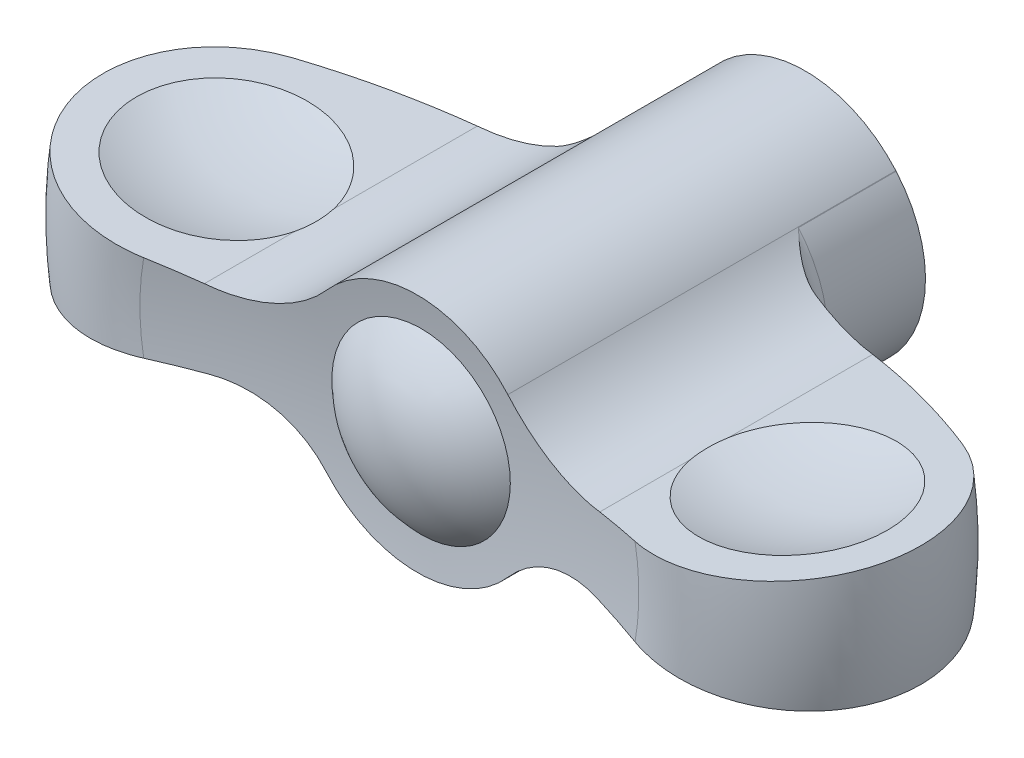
ISO-10303-21;
HEADER;
FILE_DESCRIPTION(('STEP AP214'),'2;1');
FILE_NAME('part.step','',(''),(''),'','','');
FILE_SCHEMA(('AUTOMOTIVE_DESIGN { 1 0 10303 214 1 1 1 1 }'));
ENDSEC;
DATA;
#1=APPLICATION_CONTEXT('core data for automotive mechanical design processes');
#2=APPLICATION_PROTOCOL_DEFINITION('international standard','automotive_design',2000,#1);
#3=PRODUCT_CONTEXT('',#1,'mechanical');
#4=PRODUCT('Part','Part','',(#3));
#5=PRODUCT_RELATED_PRODUCT_CATEGORY('part','',(#4));
#6=PRODUCT_DEFINITION_FORMATION('','',#4);
#7=PRODUCT_DEFINITION_CONTEXT('part definition',#1,'design');
#8=PRODUCT_DEFINITION('design','',#6,#7);
#9=PRODUCT_DEFINITION_SHAPE('','',#8);
#10=(LENGTH_UNIT() NAMED_UNIT(*) SI_UNIT(.MILLI.,.METRE.));
#11=(NAMED_UNIT(*) PLANE_ANGLE_UNIT() SI_UNIT($,.RADIAN.));
#12=(NAMED_UNIT(*) SI_UNIT($,.STERADIAN.) SOLID_ANGLE_UNIT());
#13=UNCERTAINTY_MEASURE_WITH_UNIT(LENGTH_MEASURE(1.E-05),#10,'distance_accuracy_value','');
#14=(GEOMETRIC_REPRESENTATION_CONTEXT(3) GLOBAL_UNCERTAINTY_ASSIGNED_CONTEXT((#13)) GLOBAL_UNIT_ASSIGNED_CONTEXT((#10,
#11,#12)) REPRESENTATION_CONTEXT('',''));
#15=CARTESIAN_POINT('',(0.,0.,0.));
#16=DIRECTION('',(0.,0.,1.));
#17=DIRECTION('',(1.,0.,0.));
#18=AXIS2_PLACEMENT_3D('',#15,#16,#17);
#19=CARTESIAN_POINT('',(0.,0.,6.5));
#20=DIRECTION('',(0.,0.,1.));
#21=DIRECTION('',(0.,-1.,0.));
#22=AXIS2_PLACEMENT_3D('',#19,#20,#21);
#23=TOROIDAL_SURFACE('',#22,9.4,1.40000000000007);
#24=DIRECTION('',(0.,0.,1.));
#25=VECTOR('',#24,1.);
#26=CARTESIAN_POINT('',(6.03890778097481,-5.2470556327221,-7.02196379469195));
#27=LINE('',#26,#25);
#28=CARTESIAN_POINT('',(6.03890778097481,-5.24705563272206,6.5));
#29=VERTEX_POINT('',#28);
#30=CARTESIAN_POINT('',(6.03890778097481,-5.2470556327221,6.5021200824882));
#31=VERTEX_POINT('',#30);
#32=EDGE_CURVE('E174',#29,#31,#27,.T.);
#33=ORIENTED_EDGE('',*,*,#32,.F.);
#34=CARTESIAN_POINT('',(0.,0.,6.5));
#35=DIRECTION('',(0.,0.,1.));
#36=DIRECTION('',(0.,-1.,0.));
#37=AXIS2_PLACEMENT_3D('',#34,#35,#36);
#38=CIRCLE('',#37,8.);
#39=CARTESIAN_POINT('',(6.0470062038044,5.23772049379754,6.4999999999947));
#40=VERTEX_POINT('',#39);
#41=EDGE_CURVE('E415',#29,#40,#38,.T.);
#42=ORIENTED_EDGE('',*,*,#41,.T.);
#43=CARTESIAN_POINT('',(8.59708199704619,3.29504177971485,7.88661989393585));
#44=CARTESIAN_POINT('',(8.50944178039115,3.33729136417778,7.87729621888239));
#45=CARTESIAN_POINT('',(8.42307614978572,3.38091432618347,7.86348310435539));
#46=CARTESIAN_POINT('',(8.25334791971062,3.47048341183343,7.82827393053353));
#47=CARTESIAN_POINT('',(8.16997966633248,3.51642472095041,7.80689307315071));
#48=CARTESIAN_POINT('',(8.006927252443,3.6100455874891,7.75806975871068));
#49=CARTESIAN_POINT('',(7.92722117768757,3.65771052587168,7.73067131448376));
#50=CARTESIAN_POINT('',(7.77086822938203,3.75487699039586,7.67078020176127));
#51=CARTESIAN_POINT('',(7.69422278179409,3.80437935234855,7.6382851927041));
#52=CARTESIAN_POINT('',(7.51481068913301,3.9245724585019,7.55570149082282));
#53=CARTESIAN_POINT('',(7.41345025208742,3.996030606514,7.50367899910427));
#54=CARTESIAN_POINT('',(7.21620642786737,4.14190058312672,7.39355525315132));
#55=CARTESIAN_POINT('',(7.12032815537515,4.21631506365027,7.33544846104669));
#56=CARTESIAN_POINT('',(6.89765495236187,4.39723051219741,7.19147911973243));
#57=CARTESIAN_POINT('',(6.77323076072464,4.50501816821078,7.10356810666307));
#58=CARTESIAN_POINT('',(6.57394920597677,4.68848676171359,6.95337103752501));
#59=CARTESIAN_POINT('',(6.49659267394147,4.7626588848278,6.89250585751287));
#60=CARTESIAN_POINT('',(6.37240043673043,4.8865809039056,6.79132557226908));
#61=CARTESIAN_POINT('',(6.32451434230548,4.93561192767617,6.75141880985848));
#62=CARTESIAN_POINT('',(6.24744938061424,5.01656740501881,6.68590586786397));
#63=CARTESIAN_POINT('',(6.21784284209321,5.04817964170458,6.66041557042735));
#64=CARTESIAN_POINT('',(6.1701203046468,5.09997024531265,6.61881307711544));
#65=CARTESIAN_POINT('',(6.15183084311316,5.12002285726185,6.60274326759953));
#66=CARTESIAN_POINT('',(6.12231217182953,5.15271930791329,6.57655539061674));
#67=CARTESIAN_POINT('',(6.11100884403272,5.16531979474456,6.56646663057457));
#68=CARTESIAN_POINT('',(6.09275021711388,5.18580384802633,6.549990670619));
#69=CARTESIAN_POINT('',(6.08575717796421,5.19368060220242,6.54363714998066));
#70=CARTESIAN_POINT('',(6.07446460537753,5.20645064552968,6.53319636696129));
#71=CARTESIAN_POINT('',(6.07013806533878,5.21135545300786,6.52915239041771));
#72=CARTESIAN_POINT('',(6.06316395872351,5.21928103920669,6.52242537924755));
#73=CARTESIAN_POINT('',(6.06049083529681,5.22232358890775,6.51979601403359));
#74=CARTESIAN_POINT('',(6.05620285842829,5.22721145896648,6.51533355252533));
#75=CARTESIAN_POINT('',(6.05455913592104,5.22908696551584,6.51356171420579));
#76=CARTESIAN_POINT('',(6.05194270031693,5.23207504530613,6.51046552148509));
#77=CARTESIAN_POINT('',(6.05093886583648,5.23322217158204,6.50920550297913));
#78=CARTESIAN_POINT('',(6.04952852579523,5.23483466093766,6.50714224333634));
#79=CARTESIAN_POINT('',(6.04907130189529,5.23535757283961,6.50641962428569));
#80=CARTESIAN_POINT('',(6.04823146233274,5.23631829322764,6.50488003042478));
#81=CARTESIAN_POINT('',(6.04784824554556,5.23675678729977,6.50406390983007));
#82=CARTESIAN_POINT('',(6.04743475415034,5.2372299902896,6.50282878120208));
#83=CARTESIAN_POINT('',(6.04733123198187,5.23734847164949,6.50246832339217));
#84=CARTESIAN_POINT('',(6.04716301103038,5.23754100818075,6.50172769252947));
#85=CARTESIAN_POINT('',(6.04709815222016,5.23761524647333,6.50134760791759));
#86=CARTESIAN_POINT('',(6.04703697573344,5.23768527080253,6.50077037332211));
#87=CARTESIAN_POINT('',(6.04702259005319,5.23770173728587,6.50057747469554));
#88=CARTESIAN_POINT('',(6.0470060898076,5.23772062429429,6.50018965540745));
#89=CARTESIAN_POINT('',(6.04700402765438,5.23772298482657,6.49999472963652));
#90=CARTESIAN_POINT('',(6.0470084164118,5.23771796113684,6.49979999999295));
#91=B_SPLINE_CURVE_WITH_KNOTS('',3,(#43,#44,#45,#46,#47,#48,#49,#50,#51,#52,#53,#54,#55,#56,#57,
#58,#59,#60,#61,#62,#63,#64,#65,#66,#67,#68,#69,#70,#71,#72,#73,#74,#75,#76,#77,#78,#79,#80,#81,
#82,#83,#84,#85,#86,#87,#88,#89,#90),.UNSPECIFIED.,.F.,.F.,(4,2,2,2,2,2,2,2,2,2,2,2,2,2,2,2,2,2,
2,2,2,2,2,4),(0.,0.292919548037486,0.585253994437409,0.875517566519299,1.16591483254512,
1.56900991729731,1.97247513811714,2.53185645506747,2.90152662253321,3.1394263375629,
3.29018867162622,3.38481100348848,3.44392835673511,3.48083041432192,3.50389909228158,
3.51838177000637,3.52755772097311,3.53347737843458,3.53648190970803,3.53946090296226,
3.54063718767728,3.54180856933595,3.54239014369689,3.5429741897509),.UNSPECIFIED.);
#92=CARTESIAN_POINT('',(8.59520200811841,3.29594858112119,7.88641989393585));
#93=VERTEX_POINT('',#92);
#94=EDGE_CURVE('E383',#93,#40,#91,.T.);
#95=ORIENTED_EDGE('',*,*,#94,.F.);
#96=CARTESIAN_POINT('',(0.,0.,7.88641989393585));
#97=DIRECTION('',(0.,0.,1.));
#98=DIRECTION('',(0.,-1.,0.));
#99=AXIS2_PLACEMENT_3D('',#96,#97,#98);
#100=CIRCLE('',#99,9.20547525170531);
#101=CARTESIAN_POINT('',(8.59545916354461,-3.29527789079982,7.88641989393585));
#102=VERTEX_POINT('',#101);
#103=EDGE_CURVE('E411',#102,#93,#100,.T.);
#104=ORIENTED_EDGE('',*,*,#103,.F.);
#105=CARTESIAN_POINT('',(9.2464198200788,-3.01597169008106,7.86154869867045));
#106=CARTESIAN_POINT('',(9.191703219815,-3.03662617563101,7.87246212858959));
#107=CARTESIAN_POINT('',(9.13683292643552,-3.05803382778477,7.88088984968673));
#108=CARTESIAN_POINT('',(9.0272184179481,-3.10220967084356,7.89317258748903));
#109=CARTESIAN_POINT('',(8.97247413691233,-3.12497578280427,7.89703441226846));
#110=CARTESIAN_POINT('',(8.80995844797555,-3.19470660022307,7.90236716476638));
#111=CARTESIAN_POINT('',(8.70276195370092,-3.24353448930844,7.89779252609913));
#112=CARTESIAN_POINT('',(8.51047394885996,-3.33625869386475,7.87741400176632));
#113=CARTESIAN_POINT('',(8.42481297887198,-3.37951008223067,7.86372857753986));
#114=CARTESIAN_POINT('',(8.25627111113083,-3.46839491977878,7.82888132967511));
#115=CARTESIAN_POINT('',(8.17339149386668,-3.51402944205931,7.80771611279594));
#116=CARTESIAN_POINT('',(7.92832133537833,-3.65460006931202,7.73466741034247));
#117=CARTESIAN_POINT('',(7.77073045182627,-3.75270198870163,7.67337075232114));
#118=CARTESIAN_POINT('',(7.51219223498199,-3.92592329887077,7.55434149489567));
#119=CARTESIAN_POINT('',(7.40810830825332,-3.99942155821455,7.50076399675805));
#120=CARTESIAN_POINT('',(7.20573498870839,-4.14951628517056,7.38724676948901));
#121=CARTESIAN_POINT('',(7.10744753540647,-4.22611377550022,7.32730492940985));
#122=CARTESIAN_POINT('',(6.91648045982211,-4.38209339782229,7.20294133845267));
#123=CARTESIAN_POINT('',(6.82379096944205,-4.46147021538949,7.13852792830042));
#124=CARTESIAN_POINT('',(6.64338510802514,-4.62314447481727,7.00654560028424));
#125=CARTESIAN_POINT('',(6.55566785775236,-4.70544139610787,6.93897724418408));
#126=CARTESIAN_POINT('',(6.43300905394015,-4.82577735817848,6.84059313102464));
#127=CARTESIAN_POINT('',(6.39621820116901,-4.86258512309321,6.8105538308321));
#128=CARTESIAN_POINT('',(6.32347498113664,-4.93679114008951,6.75019039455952));
#129=CARTESIAN_POINT('',(6.28752259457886,-4.97418937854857,6.71986626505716));
#130=CARTESIAN_POINT('',(6.23420044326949,-5.03074553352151,6.67427938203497));
#131=CARTESIAN_POINT('',(6.21653276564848,-5.04966820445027,6.65907163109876));
#132=CARTESIAN_POINT('',(6.18141428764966,-5.08764734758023,6.62856921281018));
#133=CARTESIAN_POINT('',(6.16396349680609,-5.10670382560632,6.61327454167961));
#134=CARTESIAN_POINT('',(6.12918837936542,-5.14505447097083,6.58285648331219));
#135=CARTESIAN_POINT('',(6.11186402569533,-5.16434858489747,6.5677330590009));
#136=CARTESIAN_POINT('',(6.07769243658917,-5.20276831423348,6.53674407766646));
#137=CARTESIAN_POINT('',(6.06084502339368,-5.22189399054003,6.52087880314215));
#138=CARTESIAN_POINT('',(6.04125233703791,-5.24436286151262,6.50407138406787));
#139=CARTESIAN_POINT('',(6.03883132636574,-5.24714312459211,6.5020224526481));
#140=CARTESIAN_POINT('',(6.036402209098,-5.24993655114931,6.5));
#141=B_SPLINE_CURVE_WITH_KNOTS('',3,(#105,#106,#107,#108,#109,#110,#111,#112,#113,#114,#115,
#116,#117,#118,#119,#120,#121,#122,#123,#124,#125,#126,#127,#128,#129,#130,#131,#132,#133,#134,
#135,#136,#137,#138,#139,#140),.UNSPECIFIED.,.F.,.F.,(4,2,2,2,2,2,2,2,2,2,2,2,2,2,2,2,2,4),(0.,
0.178341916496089,0.356417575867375,0.708892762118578,0.999321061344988,1.28988128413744,
1.87442815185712,2.28884312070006,2.7033959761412,3.11719533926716,3.53092130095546,
3.71118323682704,3.89144102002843,3.98151493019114,4.07159278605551,4.16165075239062,
4.25167469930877,4.26432797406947),.UNSPECIFIED.);
#142=EDGE_CURVE('E353',#31,#102,#141,.F.);
#143=ORIENTED_EDGE('',*,*,#142,.F.);
#144=EDGE_LOOP('',(#33,#42,#95,#104,#143));
#145=FACE_BOUND('',#144,.T.);
#146=ADVANCED_FACE('F14',(#145),#23,.F.);
#147=CARTESIAN_POINT('',(7.9999999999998,0.,0.));
#148=DIRECTION('',(0.,0.,-1.));
#149=DIRECTION('',(0.,1.,0.));
#150=AXIS2_PLACEMENT_3D('',#147,#148,#149);
#151=PLANE('',#150);
#152=CARTESIAN_POINT('',(0.,0.,0.));
#153=DIRECTION('',(0.,0.,1.));
#154=DIRECTION('',(0.,-1.,0.));
#155=AXIS2_PLACEMENT_3D('',#152,#153,#154);
#156=CIRCLE('',#155,4.);
#157=CARTESIAN_POINT('',(0.,-4.,0.));
#158=VERTEX_POINT('',#157);
#159=EDGE_CURVE('E422',#158,#158,#156,.T.);
#160=ORIENTED_EDGE('',*,*,#159,.T.);
#161=EDGE_LOOP('',(#160));
#162=FACE_BOUND('',#161,.T.);
#163=CARTESIAN_POINT('',(12.0717114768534,10.5010774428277,0.));
#164=DIRECTION('',(0.,0.,-1.));
#165=DIRECTION('',(0.,1.,0.));
#166=AXIS2_PLACEMENT_3D('',#163,#164,#165);
#167=CIRCLE('',#166,8.);
#168=CARTESIAN_POINT('',(6.0470062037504,5.23772049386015,0.));
#169=VERTEX_POINT('',#168);
#170=CARTESIAN_POINT('',(6.02470527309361,5.26335694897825,0.));
#171=VERTEX_POINT('',#170);
#172=EDGE_CURVE('E264',#169,#171,#167,.T.);
#173=ORIENTED_EDGE('',*,*,#172,.F.);
#174=CARTESIAN_POINT('',(0.,0.,0.));
#175=DIRECTION('',(0.,0.,1.));
#176=DIRECTION('',(0.,-1.,0.));
#177=AXIS2_PLACEMENT_3D('',#174,#175,#176);
#178=CIRCLE('',#177,8.);
#179=CARTESIAN_POINT('',(-6.04700620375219,5.23772049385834,0.));
#180=VERTEX_POINT('',#179);
#181=EDGE_CURVE('E419',#180,#169,#178,.T.);
#182=ORIENTED_EDGE('',*,*,#181,.F.);
#183=CARTESIAN_POINT('',(-12.0717114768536,10.5010774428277,0.));
#184=DIRECTION('',(0.,0.,-1.));
#185=DIRECTION('',(0.,1.,0.));
#186=AXIS2_PLACEMENT_3D('',#183,#184,#185);
#187=CIRCLE('',#186,8.);
#188=CARTESIAN_POINT('',(-6.0247052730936,5.26335694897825,0.));
#189=VERTEX_POINT('',#188);
#190=EDGE_CURVE('E459',#180,#189,#187,.F.);
#191=ORIENTED_EDGE('',*,*,#190,.T.);
#192=EDGE_CURVE('E418',#171,#189,#178,.T.);
#193=ORIENTED_EDGE('',*,*,#192,.F.);
#194=EDGE_LOOP('',(#173,#182,#191,#193));
#195=FACE_BOUND('',#194,.T.);
#196=ADVANCED_FACE('F375',(#162,#195),#151,.T.);
#197=CARTESIAN_POINT('',(0.,0.,32.9780362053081));
#198=DIRECTION('',(0.,0.,1.));
#199=DIRECTION('',(0.,-1.,0.));
#200=AXIS2_PLACEMENT_3D('',#197,#198,#199);
#201=CYLINDRICAL_SURFACE('',#200,8.);
#202=DIRECTION('',(0.,0.,1.));
#203=VECTOR('',#202,1.);
#204=CARTESIAN_POINT('',(-6.0247052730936,5.26335694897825,-7.02196379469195));
#205=LINE('',#204,#203);
#206=CARTESIAN_POINT('',(-6.0247052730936,5.26335694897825,25.8131362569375));
#207=VERTEX_POINT('',#206);
#208=EDGE_CURVE('E158',#189,#207,#205,.T.);
#209=ORIENTED_EDGE('',*,*,#208,.T.);
#210=CARTESIAN_POINT('',(0.,0.,25.8131362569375));
#211=DIRECTION('',(0.,0.,1.));
#212=DIRECTION('',(0.,-1.,0.));
#213=AXIS2_PLACEMENT_3D('',#210,#211,#212);
#214=CIRCLE('',#213,8.);
#215=CARTESIAN_POINT('',(6.02470527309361,5.26335694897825,25.8131362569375));
#216=VERTEX_POINT('',#215);
#217=EDGE_CURVE('E269',#216,#207,#214,.T.);
#218=ORIENTED_EDGE('',*,*,#217,.F.);
#219=DIRECTION('',(0.,0.,1.));
#220=VECTOR('',#219,1.);
#221=CARTESIAN_POINT('',(6.02470527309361,5.26335694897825,-7.02196379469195));
#222=LINE('',#221,#220);
#223=EDGE_CURVE('E161',#171,#216,#222,.T.);
#224=ORIENTED_EDGE('',*,*,#223,.F.);
#225=ORIENTED_EDGE('',*,*,#192,.T.);
#226=EDGE_LOOP('',(#209,#218,#224,#225));
#227=FACE_BOUND('',#226,.T.);
#228=ADVANCED_FACE('F270',(#227),#201,.T.);
#229=DIRECTION('',(0.,0.,1.));
#230=VECTOR('',#229,1.);
#231=CARTESIAN_POINT('',(-6.04700620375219,5.23772049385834,3.25));
#232=LINE('',#231,#230);
#233=CARTESIAN_POINT('',(-6.04700620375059,5.23772049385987,6.5));
#234=VERTEX_POINT('',#233);
#235=EDGE_CURVE('E456',#180,#234,#232,.T.);
#236=ORIENTED_EDGE('',*,*,#235,.F.);
#237=ORIENTED_EDGE('',*,*,#181,.T.);
#238=DIRECTION('',(0.,0.,1.));
#239=VECTOR('',#238,1.);
#240=CARTESIAN_POINT('',(6.0470062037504,5.23772049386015,3.25));
#241=LINE('',#240,#239);
#242=EDGE_CURVE('E390',#169,#40,#241,.T.);
#243=ORIENTED_EDGE('',*,*,#242,.T.);
#244=ORIENTED_EDGE('',*,*,#41,.F.);
#245=ORIENTED_EDGE('',*,*,#32,.T.);
#246=CARTESIAN_POINT('',(6.03890778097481,-5.2470556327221,25.8131362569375));
#247=VERTEX_POINT('',#246);
#248=EDGE_CURVE('E171',#31,#247,#27,.T.);
#249=ORIENTED_EDGE('',*,*,#248,.T.);
#250=CARTESIAN_POINT('',(0.,0.,25.8131362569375));
#251=DIRECTION('',(0.,0.,1.));
#252=DIRECTION('',(0.,-1.,0.));
#253=AXIS2_PLACEMENT_3D('',#250,#251,#252);
#254=CIRCLE('',#253,8.);
#255=CARTESIAN_POINT('',(-6.0389077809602,-5.24705563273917,25.8131362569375));
#256=VERTEX_POINT('',#255);
#257=EDGE_CURVE('E329',#256,#247,#254,.T.);
#258=ORIENTED_EDGE('',*,*,#257,.F.);
#259=DIRECTION('',(0.,0.,1.));
#260=VECTOR('',#259,1.);
#261=CARTESIAN_POINT('',(-6.03890778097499,-5.2470556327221,-7.02196379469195));
#262=LINE('',#261,#260);
#263=CARTESIAN_POINT('',(-6.03890778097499,-5.2470556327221,6.5021200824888));
#264=VERTEX_POINT('',#263);
#265=EDGE_CURVE('E167',#264,#256,#262,.T.);
#266=ORIENTED_EDGE('',*,*,#265,.F.);
#267=CARTESIAN_POINT('',(-6.03890778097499,-5.24705563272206,6.5));
#268=VERTEX_POINT('',#267);
#269=EDGE_CURVE('E170',#268,#264,#262,.T.);
#270=ORIENTED_EDGE('',*,*,#269,.F.);
#271=EDGE_CURVE('E414',#234,#268,#38,.T.);
#272=ORIENTED_EDGE('',*,*,#271,.F.);
#273=EDGE_LOOP('',(#236,#237,#243,#244,#245,#249,#258,#266,#270,#272));
#274=FACE_BOUND('',#273,.T.);
#275=ADVANCED_FACE('F447',(#274),#201,.T.);
#276=ORIENTED_EDGE('',*,*,#271,.T.);
#277=ORIENTED_EDGE('',*,*,#269,.T.);
#278=CARTESIAN_POINT('',(-9.246419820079,-3.01597169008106,7.86154869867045));
#279=CARTESIAN_POINT('',(-9.19170321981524,-3.03662617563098,7.87246212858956));
#280=CARTESIAN_POINT('',(-9.1368329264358,-3.05803382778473,7.88088984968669));
#281=CARTESIAN_POINT('',(-9.02721841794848,-3.10220967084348,7.89317258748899));
#282=CARTESIAN_POINT('',(-8.97247413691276,-3.12497578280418,7.89703441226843));
#283=CARTESIAN_POINT('',(-8.80995844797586,-3.19470660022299,7.9023671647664));
#284=CARTESIAN_POINT('',(-8.70276195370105,-3.24353448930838,7.89779252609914));
#285=CARTESIAN_POINT('',(-8.51047394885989,-3.33625869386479,7.87741400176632));
#286=CARTESIAN_POINT('',(-8.42481297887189,-3.37951008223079,7.86372857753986));
#287=CARTESIAN_POINT('',(-8.25627111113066,-3.46839491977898,7.82888132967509));
#288=CARTESIAN_POINT('',(-8.17339149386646,-3.51402944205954,7.80771611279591));
#289=CARTESIAN_POINT('',(-7.92832133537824,-3.65460006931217,7.73466741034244));
#290=CARTESIAN_POINT('',(-7.77073045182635,-3.75270198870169,7.67337075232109));
#291=CARTESIAN_POINT('',(-7.51219223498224,-3.92592329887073,7.55434149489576));
#292=CARTESIAN_POINT('',(-7.40810830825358,-3.99942155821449,7.50076399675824));
#293=CARTESIAN_POINT('',(-7.20573498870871,-4.14951628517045,7.38724676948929));
#294=CARTESIAN_POINT('',(-7.10744753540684,-4.22611377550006,7.32730492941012));
#295=CARTESIAN_POINT('',(-6.91648045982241,-4.38209339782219,7.20294133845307));
#296=CARTESIAN_POINT('',(-6.82379096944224,-4.46147021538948,7.13852792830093));
#297=CARTESIAN_POINT('',(-6.64338510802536,-4.62314447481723,7.00654560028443));
#298=CARTESIAN_POINT('',(-6.5556678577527,-4.7054413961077,6.93897724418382));
#299=CARTESIAN_POINT('',(-6.43300905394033,-4.82577735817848,6.84059313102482));
#300=CARTESIAN_POINT('',(-6.39621820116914,-4.86258512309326,6.81055383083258));
#301=CARTESIAN_POINT('',(-6.3234749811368,-4.93679114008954,6.75019039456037));
#302=CARTESIAN_POINT('',(-6.28752259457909,-4.97418937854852,6.71986626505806));
#303=CARTESIAN_POINT('',(-6.23420044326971,-5.03074553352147,6.6742793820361));
#304=CARTESIAN_POINT('',(-6.21653276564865,-5.04966820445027,6.65907163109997));
#305=CARTESIAN_POINT('',(-6.18141428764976,-5.08764734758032,6.62856921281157));
#306=CARTESIAN_POINT('',(-6.16396349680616,-5.10670382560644,6.61327454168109));
#307=CARTESIAN_POINT('',(-6.12918837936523,-5.14505447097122,6.58285648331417));
#308=CARTESIAN_POINT('',(-6.11186402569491,-5.1643485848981,6.56773305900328));
#309=CARTESIAN_POINT('',(-6.07769243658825,-5.20276831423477,6.53674407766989));
#310=CARTESIAN_POINT('',(-6.06084502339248,-5.22189399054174,6.52087880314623));
#311=CARTESIAN_POINT('',(-6.04125233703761,-5.24436286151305,6.50407138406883));
#312=CARTESIAN_POINT('',(-6.03883132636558,-5.24714312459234,6.50202245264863));
#313=CARTESIAN_POINT('',(-6.036402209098,-5.2499365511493,6.5));
#314=B_SPLINE_CURVE_WITH_KNOTS('',3,(#278,#279,#280,#281,#282,#283,#284,#285,#286,#287,#288,
#289,#290,#291,#292,#293,#294,#295,#296,#297,#298,#299,#300,#301,#302,#303,#304,#305,#306,#307,
#308,#309,#310,#311,#312,#313),.UNSPECIFIED.,.F.,.F.,(4,2,2,2,2,2,2,2,2,2,2,2,2,2,2,2,2,4),(0.,
0.178341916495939,0.356417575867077,0.708892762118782,0.999321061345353,1.28988128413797,
1.8744281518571,2.28884312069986,2.70339597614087,3.11719533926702,3.53092130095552,
3.71118323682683,3.89144102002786,3.98151493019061,4.07159278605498,4.16165075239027,
4.25167469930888,4.2643279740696),.UNSPECIFIED.);
#315=CARTESIAN_POINT('',(-8.59545916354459,-3.29527789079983,7.88641989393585));
#316=VERTEX_POINT('',#315);
#317=EDGE_CURVE('E354',#264,#316,#314,.F.);
#318=ORIENTED_EDGE('',*,*,#317,.T.);
#319=CARTESIAN_POINT('',(-8.5952020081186,3.29594858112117,7.88641989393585));
#320=VERTEX_POINT('',#319);
#321=EDGE_CURVE('E410',#320,#316,#100,.T.);
#322=ORIENTED_EDGE('',*,*,#321,.F.);
#323=CARTESIAN_POINT('',(-8.59708199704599,3.29504177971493,7.88661989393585));
#324=CARTESIAN_POINT('',(-8.50944178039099,3.33729136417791,7.87729621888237));
#325=CARTESIAN_POINT('',(-8.42307614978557,3.38091432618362,7.86348310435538));
#326=CARTESIAN_POINT('',(-8.25334791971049,3.47048341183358,7.82827393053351));
#327=CARTESIAN_POINT('',(-8.16997966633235,3.51642472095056,7.80689307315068));
#328=CARTESIAN_POINT('',(-8.00692725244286,3.61004558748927,7.75806975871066));
#329=CARTESIAN_POINT('',(-7.92722117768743,3.65771052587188,7.73067131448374));
#330=CARTESIAN_POINT('',(-7.77086822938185,3.75487699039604,7.67078020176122));
#331=CARTESIAN_POINT('',(-7.69422278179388,3.80437935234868,7.63828519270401));
#332=CARTESIAN_POINT('',(-7.51481068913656,3.92457245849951,7.55570149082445));
#333=CARTESIAN_POINT('',(-7.41345025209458,3.99603060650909,7.50367899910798));
#334=CARTESIAN_POINT('',(-7.21620642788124,4.14190058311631,7.39355525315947));
#335=CARTESIAN_POINT('',(-7.12032815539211,4.2163150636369,7.33544846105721));
#336=CARTESIAN_POINT('',(-6.8976549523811,4.39723051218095,7.19147911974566));
#337=CARTESIAN_POINT('',(-6.77323076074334,4.50501816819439,7.1035681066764));
#338=CARTESIAN_POINT('',(-6.57394920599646,4.68848676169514,6.95337103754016));
#339=CARTESIAN_POINT('',(-6.49659267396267,4.76265888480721,6.89250585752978));
#340=CARTESIAN_POINT('',(-6.37240043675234,4.88658090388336,6.7913255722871));
#341=CARTESIAN_POINT('',(-6.32451434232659,4.93561192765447,6.7514188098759));
#342=CARTESIAN_POINT('',(-6.24744938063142,5.01656740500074,6.68590586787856));
#343=CARTESIAN_POINT('',(-6.21784284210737,5.04817964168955,6.66041557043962));
#344=CARTESIAN_POINT('',(-6.17012030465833,5.09997024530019,6.61881307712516));
#345=CARTESIAN_POINT('',(-6.1518308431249,5.12002285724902,6.60274326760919));
#346=CARTESIAN_POINT('',(-6.12231217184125,5.15271930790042,6.57655539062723));
#347=CARTESIAN_POINT('',(-6.11100884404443,5.16531979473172,6.56646663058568));
#348=CARTESIAN_POINT('',(-6.09275021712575,5.1858038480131,6.54999067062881));
#349=CARTESIAN_POINT('',(-6.08575717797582,5.19368060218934,6.54363714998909));
#350=CARTESIAN_POINT('',(-6.07446460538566,5.20645064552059,6.53319636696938));
#351=CARTESIAN_POINT('',(-6.07013806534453,5.21135545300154,6.52915239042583));
#352=CARTESIAN_POINT('',(-6.06316395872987,5.21928103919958,6.52242537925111));
#353=CARTESIAN_POINT('',(-6.06049083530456,5.22232358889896,6.51979601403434));
#354=CARTESIAN_POINT('',(-6.05620285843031,5.22721145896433,6.51533355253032));
#355=CARTESIAN_POINT('',(-6.05455913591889,5.22908696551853,6.51356171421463));
#356=CARTESIAN_POINT('',(-6.05194270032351,5.23207504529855,6.51046552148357));
#357=CARTESIAN_POINT('',(-6.05093886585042,5.23322217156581,6.50920550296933));
#358=CARTESIAN_POINT('',(-6.04952852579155,5.23483466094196,6.5071422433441));
#359=CARTESIAN_POINT('',(-6.0490713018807,5.23535757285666,6.50641962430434));
#360=CARTESIAN_POINT('',(-6.04823146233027,5.23631829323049,6.50488003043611));
#361=CARTESIAN_POINT('',(-6.04784824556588,5.23675678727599,6.50406390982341));
#362=CARTESIAN_POINT('',(-6.04743475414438,5.23722999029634,6.50282878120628));
#363=CARTESIAN_POINT('',(-6.04733123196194,5.23734847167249,6.50246832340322));
#364=CARTESIAN_POINT('',(-6.04716301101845,5.23754100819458,6.50172769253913));
#365=CARTESIAN_POINT('',(-6.04709815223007,5.23761524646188,6.50134760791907));
#366=CARTESIAN_POINT('',(-6.04703697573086,5.23768527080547,6.5007703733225));
#367=CARTESIAN_POINT('',(-6.04702259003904,5.23770173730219,6.50057747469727));
#368=CARTESIAN_POINT('',(-6.04700608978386,5.23772062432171,6.50018965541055));
#369=CARTESIAN_POINT('',(-6.04700402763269,5.23772298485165,6.49999472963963));
#370=CARTESIAN_POINT('',(-6.0470084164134,5.23771796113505,6.49979999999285));
#371=B_SPLINE_CURVE_WITH_KNOTS('',3,(#323,#324,#325,#326,#327,#328,#329,#330,#331,#332,#333,
#334,#335,#336,#337,#338,#339,#340,#341,#342,#343,#344,#345,#346,#347,#348,#349,#350,#351,#352,
#353,#354,#355,#356,#357,#358,#359,#360,#361,#362,#363,#364,#365,#366,#367,#368,#369,#370),
.UNSPECIFIED.,.F.,.F.,(4,2,2,2,2,2,2,2,2,2,2,2,2,2,2,2,2,2,2,2,2,2,2,4),(0.,0.292919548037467,
0.58525399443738,0.875517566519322,1.16591483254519,1.56900991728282,1.97247513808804,
2.53185645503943,2.90152662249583,3.13942633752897,3.29018867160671,3.38481100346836,
3.44392835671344,3.48083041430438,3.503899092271,3.51838176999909,3.52755772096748,
3.53347737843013,3.53648190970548,3.53946090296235,3.54063718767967,3.54180856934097,
3.54239014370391,3.54297418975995),.UNSPECIFIED.);
#372=EDGE_CURVE('E190',#320,#234,#371,.T.);
#373=ORIENTED_EDGE('',*,*,#372,.T.);
#374=EDGE_LOOP('',(#276,#277,#318,#322,#373));
#375=FACE_BOUND('',#374,.T.);
#376=ADVANCED_FACE('F377',(#375),#23,.F.);
#377=CARTESIAN_POINT('',(0.,0.,55.408674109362));
#378=DIRECTION('',(0.,0.,1.));
#379=DIRECTION('',(0.,-1.,0.));
#380=AXIS2_PLACEMENT_3D('',#377,#378,#379);
#381=DEGENERATE_TOROIDAL_SURFACE('',#380,2.53775894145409,47.9877389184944,.T.);
#382=ORIENTED_EDGE('',*,*,#103,.T.);
#383=CARTESIAN_POINT('',(5.40789714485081,6.07461400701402,7.74825077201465));
#384=CARTESIAN_POINT('',(5.5291773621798,5.89198502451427,7.7417150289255));
#385=CARTESIAN_POINT('',(5.65803975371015,5.71432205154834,7.7372582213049));
#386=CARTESIAN_POINT('',(5.92992964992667,5.37014226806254,7.7324895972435));
#387=CARTESIAN_POINT('',(6.07295642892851,5.2036248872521,7.73217756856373));
#388=CARTESIAN_POINT('',(6.37210580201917,4.88302009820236,7.73568398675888));
#389=CARTESIAN_POINT('',(6.52822111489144,4.72892587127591,7.73950015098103));
#390=CARTESIAN_POINT('',(6.85248447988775,4.43414479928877,7.75130368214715));
#391=CARTESIAN_POINT('',(7.02063240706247,4.29345781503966,7.75929100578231));
#392=CARTESIAN_POINT('',(7.36839276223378,4.02596374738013,7.77954568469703));
#393=CARTESIAN_POINT('',(7.54804576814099,3.89921061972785,7.79182895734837));
#394=CARTESIAN_POINT('',(7.9169239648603,3.66105266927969,7.82074605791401));
#395=CARTESIAN_POINT('',(8.10614934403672,3.54964814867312,7.83737997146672));
#396=CARTESIAN_POINT('',(8.49266533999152,3.34297499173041,7.87504105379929));
#397=CARTESIAN_POINT('',(8.68995161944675,3.24769781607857,7.89606588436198));
#398=CARTESIAN_POINT('',(9.09122637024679,3.07379499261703,7.94252339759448));
#399=CARTESIAN_POINT('',(9.29521479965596,2.99516924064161,7.96795605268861));
#400=CARTESIAN_POINT('',(9.70845663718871,2.854990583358,8.02319155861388));
#401=CARTESIAN_POINT('',(9.91771139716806,2.79344211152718,8.05299554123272));
#402=CARTESIAN_POINT('',(10.3400150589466,2.68771529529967,8.11688005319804));
#403=CARTESIAN_POINT('',(10.5530655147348,2.64354424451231,8.15096237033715));
#404=CARTESIAN_POINT('',(10.9815499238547,2.57272696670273,8.22326754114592));
#405=CARTESIAN_POINT('',(11.1969857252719,2.54609545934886,8.2614938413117));
#406=CARTESIAN_POINT('',(11.6284903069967,2.51043256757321,8.34184151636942));
#407=CARTESIAN_POINT('',(11.844558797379,2.50139409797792,8.38396131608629));
#408=CARTESIAN_POINT('',(12.2806577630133,2.50077046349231,8.47281848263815));
#409=CARTESIAN_POINT('',(12.5006723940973,2.50956853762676,8.51963625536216));
#410=CARTESIAN_POINT('',(12.9384709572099,2.54513800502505,8.6167995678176));
#411=CARTESIAN_POINT('',(13.156254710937,2.57191082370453,8.66714538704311));
#412=CARTESIAN_POINT('',(13.5879515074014,2.6430363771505,8.77098851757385));
#413=CARTESIAN_POINT('',(13.8018678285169,2.68737341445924,8.82448297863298));
#414=CARTESIAN_POINT('',(14.2246542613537,2.79313397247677,8.93430204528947));
#415=CARTESIAN_POINT('',(14.4335251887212,2.85455471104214,8.99062618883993));
#416=CARTESIAN_POINT('',(14.6392212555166,2.92427775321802,9.04819298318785));
#417=B_SPLINE_CURVE_WITH_KNOTS('',3,(#383,#384,#385,#386,#387,#388,#389,#390,#391,#392,#393,
#394,#395,#396,#397,#398,#399,#400,#401,#402,#403,#404,#405,#406,#407,#408,#409,#410,#411,#412,
#413,#414,#415,#416),.UNSPECIFIED.,.F.,.F.,(4,2,2,2,2,2,2,2,2,2,2,2,2,2,2,2,4),(0.,
0.657784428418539,1.31553517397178,1.9729224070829,2.63030281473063,3.2901452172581,
3.95000060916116,4.60950551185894,5.26900628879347,5.92867812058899,6.58862653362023,
7.24912809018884,7.90936359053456,8.58393530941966,9.25856052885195,9.93258417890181,
10.6064981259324),.UNSPECIFIED.);
#418=CARTESIAN_POINT('',(13.1528156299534,2.57446317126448,8.66701618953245));
#419=VERTEX_POINT('',#418);
#420=EDGE_CURVE('E391',#93,#419,#417,.T.);
#421=ORIENTED_EDGE('',*,*,#420,.T.);
#422=CARTESIAN_POINT('',(13.1526156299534,2.57444288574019,8.66696966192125));
#423=CARTESIAN_POINT('',(13.9370340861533,2.65400458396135,8.84943351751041));
#424=CARTESIAN_POINT('',(14.7168563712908,2.73310010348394,9.05185397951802));
#425=CARTESIAN_POINT('',(16.2633623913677,2.88995853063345,9.49546553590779));
#426=CARTESIAN_POINT('',(17.0300745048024,2.96772431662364,9.73655668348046));
#427=CARTESIAN_POINT('',(18.5504261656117,3.12192996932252,10.2573018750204));
#428=CARTESIAN_POINT('',(19.3040656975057,3.19836983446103,10.5369559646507));
#429=CARTESIAN_POINT('',(20.7982632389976,3.34992273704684,11.134858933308));
#430=CARTESIAN_POINT('',(21.5387829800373,3.4250318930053,11.4532044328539));
#431=CARTESIAN_POINT('',(22.2708092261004,3.49927957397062,11.7901956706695));
#432=B_SPLINE_CURVE_WITH_KNOTS('',3,(#422,#423,#424,#425,#426,#427,#428,#429,#430,#431),
.UNSPECIFIED.,.F.,.F.,(4,2,2,2,4),(0.,2.42758220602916,4.84898838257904,7.27039742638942,
9.69798251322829),.UNSPECIFIED.);
#433=CARTESIAN_POINT('',(22.2703747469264,3.49923550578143,11.7899956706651));
#434=VERTEX_POINT('',#433);
#435=EDGE_CURVE('E536',#419,#434,#432,.T.);
#436=ORIENTED_EDGE('',*,*,#435,.T.);
#437=CARTESIAN_POINT('',(0.,0.,11.7899956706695));
#438=DIRECTION('',(0.,0.,1.));
#439=DIRECTION('',(0.,-1.,0.));
#440=AXIS2_PLACEMENT_3D('',#437,#438,#439);
#441=CIRCLE('',#440,22.5436075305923);
#442=CARTESIAN_POINT('',(22.2706216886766,-3.49766351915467,11.7899956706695));
#443=VERTEX_POINT('',#442);
#444=EDGE_CURVE('E407',#443,#434,#441,.T.);
#445=ORIENTED_EDGE('',*,*,#444,.F.);
#446=CARTESIAN_POINT('',(12.9962083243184,-2.55398166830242,8.63065853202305));
#447=CARTESIAN_POINT('',(13.7943446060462,-2.63519292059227,8.81347846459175));
#448=CARTESIAN_POINT('',(14.5877985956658,-2.71592774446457,9.01694513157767));
#449=CARTESIAN_POINT('',(16.1611919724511,-2.87602226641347,9.46398142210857));
#450=CARTESIAN_POINT('',(16.9411614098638,-2.95538502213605,9.70744418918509));
#451=CARTESIAN_POINT('',(18.4876557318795,-3.11274253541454,10.2342505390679));
#452=CARTESIAN_POINT('',(19.2541805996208,-3.19073729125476,10.5175941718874));
#453=CARTESIAN_POINT('',(20.7737763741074,-3.34535784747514,11.1241962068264));
#454=CARTESIAN_POINT('',(21.5268064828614,-3.42197949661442,11.4475578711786));
#455=CARTESIAN_POINT('',(22.271056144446,-3.4977077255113,11.7901956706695));
#456=B_SPLINE_CURVE_WITH_KNOTS('',3,(#446,#447,#448,#449,#450,#451,#452,#453,#454,#455),
.UNSPECIFIED.,.F.,.F.,(4,2,2,2,4),(0.,2.46819948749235,4.92990890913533,7.3916214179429,
9.85982400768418),.UNSPECIFIED.);
#457=CARTESIAN_POINT('',(12.9964083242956,-2.5540020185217,8.63070434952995));
#458=VERTEX_POINT('',#457);
#459=EDGE_CURVE('E530',#458,#443,#456,.T.);
#460=ORIENTED_EDGE('',*,*,#459,.F.);
#461=CARTESIAN_POINT('',(5.40816196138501,-6.0746786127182,7.7482771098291));
#462=CARTESIAN_POINT('',(5.52938177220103,-5.89205626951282,7.74173743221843));
#463=CARTESIAN_POINT('',(5.65818351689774,-5.7143974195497,7.73727619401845));
#464=CARTESIAN_POINT('',(5.92995209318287,-5.37022086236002,7.73249766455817));
#465=CARTESIAN_POINT('',(6.07291819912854,-5.20370258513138,7.7321801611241));
#466=CARTESIAN_POINT('',(6.37194671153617,-4.88309096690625,7.73567453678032));
#467=CARTESIAN_POINT('',(6.52800183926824,-4.72899081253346,7.73948413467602));
#468=CARTESIAN_POINT('',(6.85214571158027,-4.43419295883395,7.75127335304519));
#469=CARTESIAN_POINT('',(7.02023433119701,-4.29349512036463,7.75925293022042));
#470=CARTESIAN_POINT('',(7.36787685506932,-4.02597472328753,7.77949081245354));
#471=CARTESIAN_POINT('',(7.54747132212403,-3.89920607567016,7.79176502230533));
#472=CARTESIAN_POINT('',(7.91623418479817,-3.66101233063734,7.82066267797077));
#473=CARTESIAN_POINT('',(8.10540276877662,-3.54958753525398,7.83728620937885));
#474=CARTESIAN_POINT('',(8.49180737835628,-3.34286928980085,7.87492522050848));
#475=CARTESIAN_POINT('',(8.68903906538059,-3.24756730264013,7.89593836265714));
#476=CARTESIAN_POINT('',(9.09020720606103,-3.0736105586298,7.94237123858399));
#477=CARTESIAN_POINT('',(9.29414361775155,-2.99495569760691,7.96779094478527));
#478=CARTESIAN_POINT('',(9.70728411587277,-2.85471488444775,8.02299934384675));
#479=CARTESIAN_POINT('',(9.91648954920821,-2.79313334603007,8.05278916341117));
#480=CARTESIAN_POINT('',(10.3386977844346,-2.68733665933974,8.11664426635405));
#481=CARTESIAN_POINT('',(10.5517021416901,-2.6431288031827,8.15071133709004));
#482=CARTESIAN_POINT('',(10.980097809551,-2.57223450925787,8.22298504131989));
#483=CARTESIAN_POINT('',(11.1954909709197,-2.5455627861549,8.26119511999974));
#484=CARTESIAN_POINT('',(11.6269140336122,-2.50981645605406,8.34150952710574));
#485=CARTESIAN_POINT('',(11.8429436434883,-2.5007347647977,8.38361228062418));
#486=CARTESIAN_POINT('',(12.2789655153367,-2.50002106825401,8.4724337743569));
#487=CARTESIAN_POINT('',(12.4989420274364,-2.50877204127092,8.51923286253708));
#488=CARTESIAN_POINT('',(12.9366686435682,-2.5442445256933,8.61635812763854));
#489=CARTESIAN_POINT('',(13.1544185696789,-2.57096746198,8.66668458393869));
#490=CARTESIAN_POINT('',(13.5860522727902,-2.6419909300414,8.77048849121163));
#491=CARTESIAN_POINT('',(13.7999393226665,-2.68627577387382,8.82396309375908));
#492=CARTESIAN_POINT('',(14.2226717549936,-2.79192997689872,8.93374204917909));
#493=CARTESIAN_POINT('',(14.4315179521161,-2.85329655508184,8.99004594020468));
#494=CARTESIAN_POINT('',(14.6371915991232,-2.92296463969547,9.04759234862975));
#495=B_SPLINE_CURVE_WITH_KNOTS('',3,(#461,#462,#463,#464,#465,#466,#467,#468,#469,#470,#471,
#472,#473,#474,#475,#476,#477,#478,#479,#480,#481,#482,#483,#484,#485,#486,#487,#488,#489,#490,
#491,#492,#493,#494),.UNSPECIFIED.,.F.,.F.,(4,2,2,2,2,2,2,2,2,2,2,2,2,2,2,2,4),(0.,
0.657668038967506,1.31530240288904,1.97257345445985,2.62983768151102,3.28956225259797,
3.9492998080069,4.60868692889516,5.26806992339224,5.92762322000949,6.58745305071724,
7.24783584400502,7.90795261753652,8.58239553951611,9.25689194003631,9.93078716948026,
10.6045727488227),.UNSPECIFIED.);
#496=EDGE_CURVE('E347',#458,#102,#495,.F.);
#497=ORIENTED_EDGE('',*,*,#496,.T.);
#498=EDGE_LOOP('',(#382,#421,#436,#445,#460,#497));
#499=FACE_BOUND('',#498,.T.);
#500=ADVANCED_FACE('F553',(#499),#381,.T.);
#501=CARTESIAN_POINT('',(0.,0.,19.5161101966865));
#502=DIRECTION('',(0.,0.,1.));
#503=DIRECTION('',(0.,-1.,0.));
#504=AXIS2_PLACEMENT_3D('',#501,#502,#503);
#505=TOROIDAL_SURFACE('',#504,19.,8.5);
#506=CARTESIAN_POINT('',(0.,0.,27.6698599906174));
#507=DIRECTION('',(0.,0.,1.));
#508=DIRECTION('',(0.,-1.,0.));
#509=AXIS2_PLACEMENT_3D('',#506,#507,#508);
#510=CIRCLE('',#509,16.5986744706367);
#511=CARTESIAN_POINT('',(16.3443249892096,-2.89465625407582,27.6698599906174));
#512=VERTEX_POINT('',#511);
#513=CARTESIAN_POINT('',(16.3437132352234,2.89810832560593,27.6698599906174));
#514=VERTEX_POINT('',#513);
#515=EDGE_CURVE('E404',#512,#514,#510,.T.);
#516=ORIENTED_EDGE('',*,*,#515,.F.);
#517=CARTESIAN_POINT('',(22.2701871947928,-3.49761930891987,11.7897956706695));
#518=CARTESIAN_POINT('',(22.4865890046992,-3.51963843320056,11.8893708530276));
#519=CARTESIAN_POINT('',(22.6987916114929,-3.54123028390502,11.9981566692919));
#520=CARTESIAN_POINT('',(23.1133331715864,-3.5834103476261,12.2332797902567));
#521=CARTESIAN_POINT('',(23.3156725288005,-3.60399860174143,12.359616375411));
#522=CARTESIAN_POINT('',(23.7089103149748,-3.64401098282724,12.6288905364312));
#523=CARTESIAN_POINT('',(23.8998162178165,-3.66343587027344,12.771817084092));
#524=CARTESIAN_POINT('',(24.2689734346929,-3.70099802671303,13.0733193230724));
#525=CARTESIAN_POINT('',(24.4472249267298,-3.71913531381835,13.2318947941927));
#526=CARTESIAN_POINT('',(24.7898897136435,-3.75400183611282,13.5636589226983));
#527=CARTESIAN_POINT('',(24.9542960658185,-3.77073036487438,13.7368548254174));
#528=CARTESIAN_POINT('',(25.2679995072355,-3.80265003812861,14.0965647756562));
#529=CARTESIAN_POINT('',(25.4172963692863,-3.81784115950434,14.2830790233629));
#530=CARTESIAN_POINT('',(25.6996801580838,-3.84657402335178,14.6680564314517));
#531=CARTESIAN_POINT('',(25.8327705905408,-3.86011612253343,14.8665169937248));
#532=CARTESIAN_POINT('',(26.0818270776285,-3.88545789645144,15.2740114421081));
#533=CARTESIAN_POINT('',(26.1977932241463,-3.89725758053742,15.4830452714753));
#534=CARTESIAN_POINT('',(26.4116662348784,-3.91901939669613,15.9099873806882));
#535=CARTESIAN_POINT('',(26.5095909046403,-3.92898334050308,16.1278866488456));
#536=CARTESIAN_POINT('',(26.6868542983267,-3.9470200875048,16.5712819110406));
#537=CARTESIAN_POINT('',(26.7661865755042,-3.95509223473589,16.7967805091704));
#538=CARTESIAN_POINT('',(26.9056523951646,-3.96928303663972,17.2536913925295));
#539=CARTESIAN_POINT('',(26.9657864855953,-3.97540174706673,17.4851035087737));
#540=CARTESIAN_POINT('',(27.0664298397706,-3.98564232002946,17.9522037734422));
#541=CARTESIAN_POINT('',(27.1069388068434,-3.98976415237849,18.1878919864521));
#542=CARTESIAN_POINT('',(27.1680180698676,-3.99597903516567,18.6616856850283));
#543=CARTESIAN_POINT('',(27.1886032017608,-3.99807359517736,18.8997892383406));
#544=CARTESIAN_POINT('',(27.2097404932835,-4.00022433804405,19.3768982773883));
#545=CARTESIAN_POINT('',(27.2102922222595,-4.00028047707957,19.6159037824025));
#546=CARTESIAN_POINT('',(27.1913600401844,-3.99835410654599,20.0930519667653));
#547=CARTESIAN_POINT('',(27.1718811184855,-3.99637210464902,20.331194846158));
#548=CARTESIAN_POINT('',(27.1130241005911,-3.99038333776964,20.8050668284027));
#549=CARTESIAN_POINT('',(27.0736391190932,-3.98637587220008,21.0407950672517));
#550=CARTESIAN_POINT('',(26.9752654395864,-3.97636624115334,21.5079930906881));
#551=CARTESIAN_POINT('',(26.9162837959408,-3.97036479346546,21.739464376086));
#552=CARTESIAN_POINT('',(26.7791326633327,-3.95640951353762,22.1965957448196));
#553=CARTESIAN_POINT('',(26.7009627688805,-3.94845564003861,22.4222557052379));
#554=CARTESIAN_POINT('',(26.5259936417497,-3.93065233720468,22.8661561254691));
#555=CARTESIAN_POINT('',(26.4291944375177,-3.92080291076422,23.0843965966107));
#556=CARTESIAN_POINT('',(26.2176548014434,-3.89927851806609,23.5119136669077));
#557=CARTESIAN_POINT('',(26.1029139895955,-3.88760351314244,23.7211900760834));
#558=CARTESIAN_POINT('',(25.8562793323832,-3.86250816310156,24.129341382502));
#559=CARTESIAN_POINT('',(25.7243811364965,-3.84908737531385,24.328213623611));
#560=CARTESIAN_POINT('',(25.4443947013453,-3.82059844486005,24.7140892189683));
#561=CARTESIAN_POINT('',(25.2963064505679,-3.8055303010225,24.9010925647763));
#562=CARTESIAN_POINT('',(24.9849941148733,-3.77385392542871,25.2619068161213));
#563=CARTESIAN_POINT('',(24.8217699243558,-3.75724568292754,25.4357176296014));
#564=CARTESIAN_POINT('',(24.4813524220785,-3.72260782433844,25.7689123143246));
#565=CARTESIAN_POINT('',(24.3041593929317,-3.70457823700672,25.9282964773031));
#566=CARTESIAN_POINT('',(23.9369192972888,-3.6672111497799,26.2316340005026));
#567=CARTESIAN_POINT('',(23.746862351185,-3.64787264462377,26.3755752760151));
#568=CARTESIAN_POINT('',(23.3553745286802,-3.60803832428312,26.6468659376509));
#569=CARTESIAN_POINT('',(23.1539438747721,-3.58754253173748,26.7742156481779));
#570=CARTESIAN_POINT('',(22.7410978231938,-3.5455349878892,27.0114526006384));
#571=CARTESIAN_POINT('',(22.5296804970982,-3.52402304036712,27.1213364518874));
#572=CARTESIAN_POINT('',(22.0984744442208,-3.48014734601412,27.3228052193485));
#573=CARTESIAN_POINT('',(21.8786886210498,-3.45778389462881,27.4143964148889));
#574=CARTESIAN_POINT('',(21.431905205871,-3.41232318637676,27.5788085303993));
#575=CARTESIAN_POINT('',(21.20489740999,-3.38922489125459,27.6516014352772));
#576=CARTESIAN_POINT('',(20.7455990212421,-3.34249077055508,27.7777299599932));
#577=CARTESIAN_POINT('',(20.5133085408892,-3.31885495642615,27.8310659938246));
#578=CARTESIAN_POINT('',(20.0450990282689,-3.27121411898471,27.9179123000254));
#579=CARTESIAN_POINT('',(19.8091801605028,-3.24720911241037,27.9514234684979));
#580=CARTESIAN_POINT('',(19.3353786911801,-3.19899928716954,27.998395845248));
#581=CARTESIAN_POINT('',(19.0974961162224,-3.17479447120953,28.0118573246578));
#582=CARTESIAN_POINT('',(18.6210318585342,-3.12631370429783,28.0186515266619));
#583=CARTESIAN_POINT('',(18.3824496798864,-3.10203770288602,28.0119491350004));
#584=CARTESIAN_POINT('',(17.9067737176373,-3.05363714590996,27.9784021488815));
#585=CARTESIAN_POINT('',(17.6696794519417,-3.02951254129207,27.9515644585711));
#586=CARTESIAN_POINT('',(17.1984347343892,-2.98156286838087,27.8779318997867));
#587=CARTESIAN_POINT('',(16.9642861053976,-2.95773798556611,27.8311252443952));
#588=CARTESIAN_POINT('',(16.500740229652,-2.91057167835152,27.7178937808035));
#589=CARTESIAN_POINT('',(16.2713428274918,-2.88723023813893,27.6514696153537));
#590=CARTESIAN_POINT('',(15.8183308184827,-2.84113576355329,27.4992830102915));
#591=CARTESIAN_POINT('',(15.5947326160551,-2.81838439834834,27.4134712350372));
#592=CARTESIAN_POINT('',(15.155526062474,-2.77369464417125,27.2232203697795));
#593=CARTESIAN_POINT('',(14.9399175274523,-2.75175623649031,27.1187817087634));
#594=CARTESIAN_POINT('',(14.5185439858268,-2.70888101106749,26.8921972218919));
#595=CARTESIAN_POINT('',(14.3127646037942,-2.68794273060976,26.7700783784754));
#596=CARTESIAN_POINT('',(13.9122402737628,-2.64718893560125,26.5089238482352));
#597=CARTESIAN_POINT('',(13.7174893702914,-2.62737281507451,26.3698974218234));
#598=CARTESIAN_POINT('',(13.4370604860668,-2.59883886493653,26.1513001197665));
#599=CARTESIAN_POINT('',(13.3466503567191,-2.58963953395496,26.077788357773));
#600=CARTESIAN_POINT('',(13.1690334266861,-2.57156681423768,25.9272071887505));
#601=CARTESIAN_POINT('',(13.081822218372,-2.56269297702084,25.8501430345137));
#602=CARTESIAN_POINT('',(12.9962083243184,-2.55398166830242,25.7713054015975));
#603=B_SPLINE_CURVE_WITH_KNOTS('',3,(#517,#518,#519,#520,#521,#522,#523,#524,#525,#526,#527,
#528,#529,#530,#531,#532,#533,#534,#535,#536,#537,#538,#539,#540,#541,#542,#543,#544,#545,#546,
#547,#548,#549,#550,#551,#552,#553,#554,#555,#556,#557,#558,#559,#560,#561,#562,#563,#564,#565,
#566,#567,#568,#569,#570,#571,#572,#573,#574,#575,#576,#577,#578,#579,#580,#581,#582,#583,#584,
#585,#586,#587,#588,#589,#590,#591,#592,#593,#594,#595,#596,#597,#598,#599,#600,#601,#602),
.UNSPECIFIED.,.F.,.F.,(4,2,2,2,2,2,2,2,2,2,2,2,2,2,2,2,2,2,2,2,2,2,2,2,2,2,2,2,2,2,2,2,2,2,2,2,
2,2,2,2,2,2,4),(0.,0.71746500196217,1.4349005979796,2.15186197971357,2.86881327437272,
3.58612197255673,4.30344145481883,5.02060549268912,5.73776568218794,6.45421425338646,
7.17091088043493,7.88758704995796,8.60427405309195,9.32042697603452,10.0365952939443,
10.7525852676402,11.4688230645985,12.1848033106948,12.9007986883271,13.6167929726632,
14.3328024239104,15.0489937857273,15.7651856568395,16.481382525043,17.1975649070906,
17.9143037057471,18.6310284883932,19.3478922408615,20.0645094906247,20.7821886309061,
21.4998524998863,22.2174839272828,22.9351056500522,23.6539777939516,24.3726035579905,
25.0916540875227,25.8106810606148,26.5315587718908,27.2524198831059,27.9721922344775,
28.691572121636,29.0421492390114,29.3922236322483),.UNSPECIFIED.);
#604=EDGE_CURVE('E366',#443,#512,#603,.T.);
#605=ORIENTED_EDGE('',*,*,#604,.F.);
#606=ORIENTED_EDGE('',*,*,#444,.T.);
#607=CARTESIAN_POINT('',(22.269940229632,3.49919143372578,11.7897956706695));
#608=CARTESIAN_POINT('',(22.4863520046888,3.52114156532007,11.8893700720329));
#609=CARTESIAN_POINT('',(22.6985645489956,3.54266577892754,11.9981550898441));
#610=CARTESIAN_POINT('',(23.1131258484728,3.58471374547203,12.2332767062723));
#611=CARTESIAN_POINT('',(23.3154750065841,3.60523753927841,12.3596125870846));
#612=CARTESIAN_POINT('',(23.7087322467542,3.64512468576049,12.6288856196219));
#613=CARTESIAN_POINT('',(23.8996477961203,3.66448879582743,12.7718117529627));
#614=CARTESIAN_POINT('',(24.2688239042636,3.7019334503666,13.0733134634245));
#615=CARTESIAN_POINT('',(24.4470846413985,3.72001401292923,13.2318888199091));
#616=CARTESIAN_POINT('',(24.7897674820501,3.75477151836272,13.5636531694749));
#617=CARTESIAN_POINT('',(24.9541826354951,3.77144775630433,13.7368494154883));
#618=CARTESIAN_POINT('',(25.267902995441,3.80326766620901,14.0965604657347));
#619=CARTESIAN_POINT('',(25.417207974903,3.81841131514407,14.2830754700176));
#620=CARTESIAN_POINT('',(25.6996071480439,3.84705439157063,14.6680547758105));
#621=CARTESIAN_POINT('',(25.8327048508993,3.86055417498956,14.8665164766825));
#622=CARTESIAN_POINT('',(26.081774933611,3.88581676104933,15.2740136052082));
#623=CARTESIAN_POINT('',(26.1977474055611,3.89757957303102,15.4830489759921));
#624=CARTESIAN_POINT('',(26.4116306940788,3.91927324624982,15.9099919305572));
#625=CARTESIAN_POINT('',(26.5095595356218,3.92920593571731,16.1278903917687));
#626=CARTESIAN_POINT('',(26.6868305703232,3.94718611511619,16.571284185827));
#627=CARTESIAN_POINT('',(26.7661663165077,3.95523295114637,16.7967821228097));
#628=CARTESIAN_POINT('',(26.9056383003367,3.96937926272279,17.2536918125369));
#629=CARTESIAN_POINT('',(26.9657750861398,3.97547879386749,17.4851033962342));
#630=CARTESIAN_POINT('',(27.0664230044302,3.98568727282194,17.9522026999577));
#631=CARTESIAN_POINT('',(27.1069338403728,3.98979619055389,18.1878904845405));
#632=CARTESIAN_POINT('',(27.1680156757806,3.99599157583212,18.6616810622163));
#633=CARTESIAN_POINT('',(27.1886017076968,3.99807956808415,18.8997818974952));
#634=CARTESIAN_POINT('',(27.2097403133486,4.00022360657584,19.3768855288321));
#635=CARTESIAN_POINT('',(27.2102924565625,4.00027960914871,19.6158883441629));
#636=CARTESIAN_POINT('',(27.1913606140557,3.99835939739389,20.0930311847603));
#637=CARTESIAN_POINT('',(27.1718816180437,3.99638368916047,20.3311714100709));
#638=CARTESIAN_POINT('',(27.1130239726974,3.9904138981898,20.8050381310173));
#639=CARTESIAN_POINT('',(27.0736384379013,3.98641911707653,21.0407637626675));
#640=CARTESIAN_POINT('',(26.9752633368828,3.97644116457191,21.5079559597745));
#641=CARTESIAN_POINT('',(26.9162808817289,3.97045871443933,21.7394240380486));
#642=CARTESIAN_POINT('',(26.7791278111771,3.95654760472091,22.1965491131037));
#643=CARTESIAN_POINT('',(26.7009567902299,3.94861890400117,22.4222059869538));
#644=CARTESIAN_POINT('',(26.5259851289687,3.93087194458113,22.8661004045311));
#645=CARTESIAN_POINT('',(26.4291845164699,3.92105368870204,23.0843379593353));
#646=CARTESIAN_POINT('',(26.217641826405,3.89959741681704,23.5118494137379));
#647=CARTESIAN_POINT('',(26.1028993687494,3.88795936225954,23.7211231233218));
#648=CARTESIAN_POINT('',(25.8562607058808,3.86294338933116,24.1292701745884));
#649=CARTESIAN_POINT('',(25.7243600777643,3.84956502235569,24.3281408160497));
#650=CARTESIAN_POINT('',(25.4443684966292,3.82116614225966,24.7140134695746));
#651=CARTESIAN_POINT('',(25.2962775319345,3.80614562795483,24.9010154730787));
#652=CARTESIAN_POINT('',(24.9849596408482,3.77456939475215,25.26182725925));
#653=CARTESIAN_POINT('',(24.821732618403,3.75801366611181,25.4356369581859));
#654=CARTESIAN_POINT('',(24.4813092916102,3.72348533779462,25.768829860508));
#655=CARTESIAN_POINT('',(24.3041132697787,3.70551276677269,25.9282133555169));
#656=CARTESIAN_POINT('',(23.9368653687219,3.66826368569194,26.2315514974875));
#657=CARTESIAN_POINT('',(23.7468034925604,3.64898616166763,26.3754939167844));
#658=CARTESIAN_POINT('',(23.3553055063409,3.60927745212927,26.6467872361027));
#659=CARTESIAN_POINT('',(23.1538696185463,3.58884628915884,26.7741384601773));
#660=CARTESIAN_POINT('',(22.7410119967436,3.54697112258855,27.0113794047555));
#661=CARTESIAN_POINT('',(22.5295882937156,3.52552691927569,27.1212656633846));
#662=CARTESIAN_POINT('',(22.0983691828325,3.48178939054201,27.3227397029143));
#663=CARTESIAN_POINT('',(21.8785766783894,3.45949635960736,27.414333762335));
#664=CARTESIAN_POINT('',(21.4317737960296,3.41417820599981,27.5787543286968));
#665=CARTESIAN_POINT('',(21.2047530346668,3.3911520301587,27.6515523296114));
#666=CARTESIAN_POINT('',(20.7454281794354,3.34456380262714,27.7776907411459));
#667=CARTESIAN_POINT('',(20.5131241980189,3.32100176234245,27.8310315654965));
#668=CARTESIAN_POINT('',(20.0448917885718,3.273510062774,27.9178864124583));
#669=CARTESIAN_POINT('',(19.808963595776,3.24958042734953,27.9514017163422));
#670=CARTESIAN_POINT('',(19.33514312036,3.20152194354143,27.9983830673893));
#671=CARTESIAN_POINT('',(19.09725086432,3.17739309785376,28.0118493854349));
#672=CARTESIAN_POINT('',(18.6207682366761,3.1290645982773,28.0186540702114));
#673=CARTESIAN_POINT('',(18.3821773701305,3.10486489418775,28.0119574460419));
#674=CARTESIAN_POINT('',(17.906483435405,3.05661638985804,27.9784231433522));
#675=CARTESIAN_POINT('',(17.6693798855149,3.03256754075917,27.951592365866));
#676=CARTESIAN_POINT('',(17.1980962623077,2.98476636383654,27.8779717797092));
#677=CARTESIAN_POINT('',(16.9639182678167,2.96101424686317,27.831168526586));
#678=CARTESIAN_POINT('',(16.5003145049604,2.91399201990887,27.7179420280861));
#679=CARTESIAN_POINT('',(16.2708885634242,2.89072189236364,27.6515194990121));
#680=CARTESIAN_POINT('',(15.8177881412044,2.84476499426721,27.4993238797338));
#681=CARTESIAN_POINT('',(15.594130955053,2.8220799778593,27.4134987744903));
#682=CARTESIAN_POINT('',(15.1548092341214,2.77752062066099,27.2232142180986));
#683=CARTESIAN_POINT('',(14.9391444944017,2.75564625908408,27.118755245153));
#684=CARTESIAN_POINT('',(14.5177209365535,2.71290226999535,26.892155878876));
#685=CARTESIAN_POINT('',(14.3119451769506,2.69203092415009,26.7700472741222));
#686=CARTESIAN_POINT('',(13.9114301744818,2.6514076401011,26.508917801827));
#687=CARTESIAN_POINT('',(13.7166843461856,2.63165503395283,26.3699071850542));
#688=CARTESIAN_POINT('',(13.4640710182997,2.60603306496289,26.1730131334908));
#689=CARTESIAN_POINT('',(13.4007037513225,2.59960587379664,26.1221461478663));
#690=CARTESIAN_POINT('',(13.2755127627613,2.58690804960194,26.0186683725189));
#691=CARTESIAN_POINT('',(13.2136874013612,2.58063725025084,25.9660595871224));
#692=CARTESIAN_POINT('',(13.1526156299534,2.57444288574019,25.9125680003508));
#693=B_SPLINE_CURVE_WITH_KNOTS('',3,(#607,#608,#609,#610,#611,#612,#613,#614,#615,#616,#617,
#618,#619,#620,#621,#622,#623,#624,#625,#626,#627,#628,#629,#630,#631,#632,#633,#634,#635,#636,
#637,#638,#639,#640,#641,#642,#643,#644,#645,#646,#647,#648,#649,#650,#651,#652,#653,#654,#655,
#656,#657,#658,#659,#660,#661,#662,#663,#664,#665,#666,#667,#668,#669,#670,#671,#672,#673,#674,
#675,#676,#677,#678,#679,#680,#681,#682,#683,#684,#685,#686,#687,#688,#689,#690,#691,#692),
.UNSPECIFIED.,.F.,.F.,(4,2,2,2,2,2,2,2,2,2,2,2,2,2,2,2,2,2,2,2,2,2,2,2,2,2,2,2,2,2,2,2,2,2,2,2,
2,2,2,2,2,2,4),(0.,0.717472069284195,1.43491480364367,2.15188374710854,2.8688425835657,
3.58615919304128,4.30348657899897,5.02065837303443,5.73782631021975,6.4542738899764,
7.17096952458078,7.88764469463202,8.60433069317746,9.3204755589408,10.0366358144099,
10.7526177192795,11.468847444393,12.1848175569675,12.9008028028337,13.6167869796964,
14.3327863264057,15.0489706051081,15.7651554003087,16.4813447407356,17.197519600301,
17.914257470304,18.6309813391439,19.3478470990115,20.0644663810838,20.7821661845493,
21.4998507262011,22.2174888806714,22.9351173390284,23.6539918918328,24.3726201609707,
25.0917329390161,25.8108194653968,26.5318570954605,27.2528762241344,27.9726125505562,
28.6919145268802,28.936425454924,29.1806641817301),.UNSPECIFIED.);
#694=EDGE_CURVE('E534',#434,#514,#693,.T.);
#695=ORIENTED_EDGE('',*,*,#694,.T.);
#696=EDGE_LOOP('',(#516,#605,#606,#695));
#697=FACE_BOUND('',#696,.T.);
#698=ADVANCED_FACE('F300',(#697),#505,.T.);
#699=CARTESIAN_POINT('',(-16.3437132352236,2.89810832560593,27.6698599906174));
#700=VERTEX_POINT('',#699);
#701=CARTESIAN_POINT('',(-16.3443249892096,-2.89465625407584,27.6698599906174));
#702=VERTEX_POINT('',#701);
#703=EDGE_CURVE('E403',#700,#702,#510,.T.);
#704=ORIENTED_EDGE('',*,*,#703,.F.);
#705=CARTESIAN_POINT('',(-22.269940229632,3.49919143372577,11.7897956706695));
#706=CARTESIAN_POINT('',(-22.4863520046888,3.52114156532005,11.8893700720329));
#707=CARTESIAN_POINT('',(-22.6985645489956,3.54266577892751,11.9981550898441));
#708=CARTESIAN_POINT('',(-23.1131258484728,3.584713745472,12.2332767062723));
#709=CARTESIAN_POINT('',(-23.3154750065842,3.60523753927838,12.3596125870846));
#710=CARTESIAN_POINT('',(-23.7087322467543,3.64512468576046,12.628885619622));
#711=CARTESIAN_POINT('',(-23.8996477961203,3.6644887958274,12.7718117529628));
#712=CARTESIAN_POINT('',(-24.2688239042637,3.70193345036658,13.0733134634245));
#713=CARTESIAN_POINT('',(-24.4470846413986,3.72001401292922,13.2318888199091));
#714=CARTESIAN_POINT('',(-24.7897674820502,3.7547715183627,13.5636531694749));
#715=CARTESIAN_POINT('',(-24.9541826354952,3.7714477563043,13.7368494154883));
#716=CARTESIAN_POINT('',(-25.267902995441,3.80326766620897,14.0965604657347));
#717=CARTESIAN_POINT('',(-25.4172079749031,3.81841131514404,14.2830754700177));
#718=CARTESIAN_POINT('',(-25.6996071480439,3.8470543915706,14.6680547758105));
#719=CARTESIAN_POINT('',(-25.8327048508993,3.86055417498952,14.8665164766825));
#720=CARTESIAN_POINT('',(-26.081774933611,3.8858167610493,15.2740136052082));
#721=CARTESIAN_POINT('',(-26.1977474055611,3.89757957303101,15.4830489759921));
#722=CARTESIAN_POINT('',(-26.4116306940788,3.9192732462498,15.9099919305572));
#723=CARTESIAN_POINT('',(-26.5095595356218,3.92920593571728,16.1278903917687));
#724=CARTESIAN_POINT('',(-26.6868305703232,3.94718611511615,16.571284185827));
#725=CARTESIAN_POINT('',(-26.7661663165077,3.95523295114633,16.7967821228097));
#726=CARTESIAN_POINT('',(-26.9056383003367,3.96937926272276,17.2536918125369));
#727=CARTESIAN_POINT('',(-26.9657750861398,3.97547879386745,17.4851033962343));
#728=CARTESIAN_POINT('',(-27.0664230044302,3.98568727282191,17.9522026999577));
#729=CARTESIAN_POINT('',(-27.1069338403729,3.98979619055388,18.1878904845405));
#730=CARTESIAN_POINT('',(-27.1680156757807,3.99599157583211,18.6616810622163));
#731=CARTESIAN_POINT('',(-27.1886017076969,3.99807956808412,18.8997818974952));
#732=CARTESIAN_POINT('',(-27.2097403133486,4.0002236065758,19.3768855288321));
#733=CARTESIAN_POINT('',(-27.2102924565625,4.00027960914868,19.6158883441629));
#734=CARTESIAN_POINT('',(-27.1913606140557,3.99835939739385,20.0930311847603));
#735=CARTESIAN_POINT('',(-27.1718816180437,3.99638368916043,20.331171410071));
#736=CARTESIAN_POINT('',(-27.1130239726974,3.99041389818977,20.8050381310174));
#737=CARTESIAN_POINT('',(-27.0736384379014,3.98641911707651,21.0407637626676));
#738=CARTESIAN_POINT('',(-26.9752633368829,3.97644116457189,21.5079559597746));
#739=CARTESIAN_POINT('',(-26.9162808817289,3.97045871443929,21.7394240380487));
#740=CARTESIAN_POINT('',(-26.779127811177,3.95654760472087,22.1965491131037));
#741=CARTESIAN_POINT('',(-26.7009567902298,3.94861890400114,22.4222059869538));
#742=CARTESIAN_POINT('',(-26.5259851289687,3.93087194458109,22.8661004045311));
#743=CARTESIAN_POINT('',(-26.4291845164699,3.921053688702,23.0843379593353));
#744=CARTESIAN_POINT('',(-26.217641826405,3.89959741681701,23.5118494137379));
#745=CARTESIAN_POINT('',(-26.1028993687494,3.88795936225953,23.7211231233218));
#746=CARTESIAN_POINT('',(-25.8562607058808,3.86294338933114,24.1292701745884));
#747=CARTESIAN_POINT('',(-25.7243600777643,3.84956502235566,24.3281408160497));
#748=CARTESIAN_POINT('',(-25.4443684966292,3.82116614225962,24.7140134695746));
#749=CARTESIAN_POINT('',(-25.2962775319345,3.80614562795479,24.9010154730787));
#750=CARTESIAN_POINT('',(-24.9849596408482,3.77456939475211,25.26182725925));
#751=CARTESIAN_POINT('',(-24.8217326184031,3.75801366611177,25.4356369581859));
#752=CARTESIAN_POINT('',(-24.4813092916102,3.72348533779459,25.768829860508));
#753=CARTESIAN_POINT('',(-24.3041132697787,3.70551276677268,25.9282133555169));
#754=CARTESIAN_POINT('',(-23.9368653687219,3.66826368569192,26.2315514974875));
#755=CARTESIAN_POINT('',(-23.7468034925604,3.6489861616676,26.3754939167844));
#756=CARTESIAN_POINT('',(-23.355305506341,3.60927745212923,26.6467872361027));
#757=CARTESIAN_POINT('',(-23.1538696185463,3.58884628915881,26.7741384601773));
#758=CARTESIAN_POINT('',(-22.7410119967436,3.54697112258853,27.0113794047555));
#759=CARTESIAN_POINT('',(-22.5295882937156,3.52552691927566,27.1212656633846));
#760=CARTESIAN_POINT('',(-22.0983691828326,3.48178939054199,27.3227397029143));
#761=CARTESIAN_POINT('',(-21.8785766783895,3.45949635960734,27.414333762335));
#762=CARTESIAN_POINT('',(-21.4317737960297,3.4141782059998,27.5787543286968));
#763=CARTESIAN_POINT('',(-21.2047530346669,3.39115203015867,27.6515523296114));
#764=CARTESIAN_POINT('',(-20.7454281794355,3.34456380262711,27.7776907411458));
#765=CARTESIAN_POINT('',(-20.513124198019,3.32100176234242,27.8310315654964));
#766=CARTESIAN_POINT('',(-20.0448917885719,3.27351006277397,27.9178864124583));
#767=CARTESIAN_POINT('',(-19.808963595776,3.2495804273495,27.9514017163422));
#768=CARTESIAN_POINT('',(-19.33514312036,3.20152194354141,27.9983830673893));
#769=CARTESIAN_POINT('',(-19.09725086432,3.17739309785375,28.0118493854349));
#770=CARTESIAN_POINT('',(-18.6207682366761,3.12906459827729,28.0186540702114));
#771=CARTESIAN_POINT('',(-18.3821773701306,3.10486489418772,28.0119574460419));
#772=CARTESIAN_POINT('',(-17.906483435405,3.056616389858,27.9784231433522));
#773=CARTESIAN_POINT('',(-17.669379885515,3.03256754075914,27.951592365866));
#774=CARTESIAN_POINT('',(-17.1980962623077,2.9847663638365,27.8779717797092));
#775=CARTESIAN_POINT('',(-16.9639182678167,2.96101424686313,27.831168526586));
#776=CARTESIAN_POINT('',(-16.5003145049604,2.91399201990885,27.7179420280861));
#777=CARTESIAN_POINT('',(-16.2708885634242,2.89072189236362,27.6515194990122));
#778=CARTESIAN_POINT('',(-15.8177881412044,2.8447649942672,27.4993238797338));
#779=CARTESIAN_POINT('',(-15.594130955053,2.82207997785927,27.4134987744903));
#780=CARTESIAN_POINT('',(-15.1548092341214,2.77752062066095,27.2232142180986));
#781=CARTESIAN_POINT('',(-14.9391444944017,2.75564625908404,27.118755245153));
#782=CARTESIAN_POINT('',(-14.5177209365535,2.71290226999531,26.892155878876));
#783=CARTESIAN_POINT('',(-14.3119451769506,2.69203092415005,26.7700472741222));
#784=CARTESIAN_POINT('',(-13.9114301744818,2.65140764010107,26.508917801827));
#785=CARTESIAN_POINT('',(-13.7166843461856,2.63165503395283,26.3699071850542));
#786=CARTESIAN_POINT('',(-13.4640710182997,2.60603306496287,26.1730131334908));
#787=CARTESIAN_POINT('',(-13.4007037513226,2.59960587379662,26.1221461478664));
#788=CARTESIAN_POINT('',(-13.2755127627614,2.58690804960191,26.0186683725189));
#789=CARTESIAN_POINT('',(-13.2136874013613,2.58063725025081,25.9660595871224));
#790=CARTESIAN_POINT('',(-13.1526156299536,2.57444288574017,25.9125680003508));
#791=B_SPLINE_CURVE_WITH_KNOTS('',3,(#705,#706,#707,#708,#709,#710,#711,#712,#713,#714,#715,
#716,#717,#718,#719,#720,#721,#722,#723,#724,#725,#726,#727,#728,#729,#730,#731,#732,#733,#734,
#735,#736,#737,#738,#739,#740,#741,#742,#743,#744,#745,#746,#747,#748,#749,#750,#751,#752,#753,
#754,#755,#756,#757,#758,#759,#760,#761,#762,#763,#764,#765,#766,#767,#768,#769,#770,#771,#772,
#773,#774,#775,#776,#777,#778,#779,#780,#781,#782,#783,#784,#785,#786,#787,#788,#789,#790),
.UNSPECIFIED.,.F.,.F.,(4,2,2,2,2,2,2,2,2,2,2,2,2,2,2,2,2,2,2,2,2,2,2,2,2,2,2,2,2,2,2,2,2,2,2,2,
2,2,2,2,2,2,4),(0.,0.717472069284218,1.43491480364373,2.1518837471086,2.86884258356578,
3.58615919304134,4.30348657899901,5.02065837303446,5.73782631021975,6.45427388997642,
7.1709695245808,7.88764469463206,8.60433069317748,9.32047555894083,10.0366358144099,
10.7526177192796,11.4688474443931,12.1848175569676,12.9008028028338,13.6167869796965,
14.3327863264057,15.0489706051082,15.7651554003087,16.4813447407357,17.197519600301,
17.914257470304,18.6309813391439,19.3478470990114,20.0644663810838,20.7821661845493,
21.4998507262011,22.2174888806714,22.9351173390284,23.6539918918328,24.3726201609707,
25.0917329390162,25.8108194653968,26.5318570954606,27.2528762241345,27.9726125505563,
28.6919145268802,28.9364254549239,29.18066418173),.UNSPECIFIED.);
#792=CARTESIAN_POINT('',(-22.2703747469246,3.49923550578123,11.7899956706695));
#793=VERTEX_POINT('',#792);
#794=EDGE_CURVE('E460',#793,#700,#791,.T.);
#795=ORIENTED_EDGE('',*,*,#794,.F.);
#796=CARTESIAN_POINT('',(-22.2706216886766,-3.49766351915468,11.7899956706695));
#797=VERTEX_POINT('',#796);
#798=EDGE_CURVE('E406',#793,#797,#441,.T.);
#799=ORIENTED_EDGE('',*,*,#798,.T.);
#800=CARTESIAN_POINT('',(-22.2701871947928,-3.49761930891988,11.7897956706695));
#801=CARTESIAN_POINT('',(-22.4865890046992,-3.51963843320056,11.8893708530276));
#802=CARTESIAN_POINT('',(-22.6987916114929,-3.54123028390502,11.9981566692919));
#803=CARTESIAN_POINT('',(-23.1133331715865,-3.5834103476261,12.2332797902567));
#804=CARTESIAN_POINT('',(-23.3156725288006,-3.60399860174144,12.359616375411));
#805=CARTESIAN_POINT('',(-23.7089103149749,-3.64401098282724,12.6288905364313));
#806=CARTESIAN_POINT('',(-23.8998162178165,-3.66343587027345,12.7718170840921));
#807=CARTESIAN_POINT('',(-24.268973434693,-3.70099802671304,13.0733193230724));
#808=CARTESIAN_POINT('',(-24.4472249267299,-3.71913531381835,13.2318947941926));
#809=CARTESIAN_POINT('',(-24.7898897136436,-3.75400183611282,13.5636589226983));
#810=CARTESIAN_POINT('',(-24.9542960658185,-3.77073036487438,13.7368548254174));
#811=CARTESIAN_POINT('',(-25.2679995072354,-3.80265003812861,14.0965647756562));
#812=CARTESIAN_POINT('',(-25.4172963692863,-3.81784115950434,14.2830790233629));
#813=CARTESIAN_POINT('',(-25.6996801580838,-3.84657402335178,14.6680564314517));
#814=CARTESIAN_POINT('',(-25.8327705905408,-3.86011612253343,14.8665169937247));
#815=CARTESIAN_POINT('',(-26.0818270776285,-3.88545789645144,15.2740114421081));
#816=CARTESIAN_POINT('',(-26.1977932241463,-3.89725758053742,15.4830452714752));
#817=CARTESIAN_POINT('',(-26.4116662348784,-3.91901939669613,15.9099873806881));
#818=CARTESIAN_POINT('',(-26.5095909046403,-3.92898334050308,16.1278866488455));
#819=CARTESIAN_POINT('',(-26.6868542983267,-3.94702008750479,16.5712819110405));
#820=CARTESIAN_POINT('',(-26.7661865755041,-3.95509223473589,16.7967805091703));
#821=CARTESIAN_POINT('',(-26.9056523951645,-3.96928303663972,17.2536913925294));
#822=CARTESIAN_POINT('',(-26.9657864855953,-3.97540174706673,17.4851035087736));
#823=CARTESIAN_POINT('',(-27.0664298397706,-3.98564232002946,17.9522037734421));
#824=CARTESIAN_POINT('',(-27.1069388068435,-3.98976415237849,18.187891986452));
#825=CARTESIAN_POINT('',(-27.1680180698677,-3.99597903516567,18.6616856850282));
#826=CARTESIAN_POINT('',(-27.1886032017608,-3.99807359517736,18.8997892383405));
#827=CARTESIAN_POINT('',(-27.2097404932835,-4.00022433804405,19.3768982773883));
#828=CARTESIAN_POINT('',(-27.2102922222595,-4.00028047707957,19.6159037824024));
#829=CARTESIAN_POINT('',(-27.1913600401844,-3.99835410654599,20.0930519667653));
#830=CARTESIAN_POINT('',(-27.1718811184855,-3.99637210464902,20.331194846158));
#831=CARTESIAN_POINT('',(-27.1130241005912,-3.99038333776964,20.8050668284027));
#832=CARTESIAN_POINT('',(-27.0736391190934,-3.98637587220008,21.0407950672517));
#833=CARTESIAN_POINT('',(-26.9752654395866,-3.97636624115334,21.5079930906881));
#834=CARTESIAN_POINT('',(-26.9162837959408,-3.97036479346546,21.739464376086));
#835=CARTESIAN_POINT('',(-26.7791326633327,-3.95640951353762,22.1965957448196));
#836=CARTESIAN_POINT('',(-26.7009627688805,-3.94845564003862,22.4222557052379));
#837=CARTESIAN_POINT('',(-26.5259936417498,-3.93065233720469,22.8661561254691));
#838=CARTESIAN_POINT('',(-26.4291944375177,-3.92080291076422,23.0843965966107));
#839=CARTESIAN_POINT('',(-26.2176548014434,-3.89927851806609,23.5119136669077));
#840=CARTESIAN_POINT('',(-26.1029139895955,-3.88760351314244,23.7211900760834));
#841=CARTESIAN_POINT('',(-25.8562793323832,-3.86250816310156,24.129341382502));
#842=CARTESIAN_POINT('',(-25.7243811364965,-3.84908737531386,24.328213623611));
#843=CARTESIAN_POINT('',(-25.4443947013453,-3.82059844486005,24.7140892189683));
#844=CARTESIAN_POINT('',(-25.2963064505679,-3.80553030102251,24.9010925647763));
#845=CARTESIAN_POINT('',(-24.9849941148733,-3.77385392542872,25.2619068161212));
#846=CARTESIAN_POINT('',(-24.8217699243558,-3.75724568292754,25.4357176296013));
#847=CARTESIAN_POINT('',(-24.4813524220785,-3.72260782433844,25.7689123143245));
#848=CARTESIAN_POINT('',(-24.3041593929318,-3.70457823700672,25.9282964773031));
#849=CARTESIAN_POINT('',(-23.9369192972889,-3.66721114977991,26.2316340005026));
#850=CARTESIAN_POINT('',(-23.746862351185,-3.64787264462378,26.375575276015));
#851=CARTESIAN_POINT('',(-23.3553745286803,-3.60803832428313,26.6468659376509));
#852=CARTESIAN_POINT('',(-23.1539438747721,-3.58754253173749,26.7742156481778));
#853=CARTESIAN_POINT('',(-22.7410978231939,-3.54553498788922,27.0114526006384));
#854=CARTESIAN_POINT('',(-22.5296804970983,-3.52402304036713,27.1213364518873));
#855=CARTESIAN_POINT('',(-22.0984744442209,-3.48014734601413,27.3228052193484));
#856=CARTESIAN_POINT('',(-21.8786886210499,-3.45778389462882,27.4143964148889));
#857=CARTESIAN_POINT('',(-21.4319052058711,-3.41232318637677,27.5788085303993));
#858=CARTESIAN_POINT('',(-21.2048974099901,-3.38922489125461,27.6516014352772));
#859=CARTESIAN_POINT('',(-20.7455990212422,-3.34249077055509,27.7777299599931));
#860=CARTESIAN_POINT('',(-20.5133085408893,-3.31885495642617,27.8310659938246));
#861=CARTESIAN_POINT('',(-20.045099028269,-3.27121411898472,27.9179123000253));
#862=CARTESIAN_POINT('',(-19.8091801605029,-3.24720911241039,27.9514234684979));
#863=CARTESIAN_POINT('',(-19.3353786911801,-3.19899928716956,27.998395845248));
#864=CARTESIAN_POINT('',(-19.0974961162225,-3.17479447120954,28.0118573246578));
#865=CARTESIAN_POINT('',(-18.6210318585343,-3.12631370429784,28.0186515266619));
#866=CARTESIAN_POINT('',(-18.3824496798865,-3.10203770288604,28.0119491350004));
#867=CARTESIAN_POINT('',(-17.9067737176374,-3.05363714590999,27.9784021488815));
#868=CARTESIAN_POINT('',(-17.6696794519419,-3.02951254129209,27.9515644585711));
#869=CARTESIAN_POINT('',(-17.1984347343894,-2.98156286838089,27.8779318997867));
#870=CARTESIAN_POINT('',(-16.9642861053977,-2.95773798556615,27.8311252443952));
#871=CARTESIAN_POINT('',(-16.5007402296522,-2.91057167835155,27.7178937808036));
#872=CARTESIAN_POINT('',(-16.271342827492,-2.88723023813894,27.6514696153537));
#873=CARTESIAN_POINT('',(-15.8183308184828,-2.8411357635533,27.4992830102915));
#874=CARTESIAN_POINT('',(-15.5947326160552,-2.81838439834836,27.4134712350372));
#875=CARTESIAN_POINT('',(-15.1555260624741,-2.77369464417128,27.2232203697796));
#876=CARTESIAN_POINT('',(-14.9399175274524,-2.75175623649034,27.1187817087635));
#877=CARTESIAN_POINT('',(-14.5185439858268,-2.70888101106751,26.8921972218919));
#878=CARTESIAN_POINT('',(-14.3127646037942,-2.68794273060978,26.7700783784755));
#879=CARTESIAN_POINT('',(-13.9122402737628,-2.64718893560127,26.5089238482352));
#880=CARTESIAN_POINT('',(-13.7174893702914,-2.62737281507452,26.3698974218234));
#881=CARTESIAN_POINT('',(-13.4370604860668,-2.59883886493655,26.1513001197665));
#882=CARTESIAN_POINT('',(-13.3466503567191,-2.58963953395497,26.077788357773));
#883=CARTESIAN_POINT('',(-13.1690334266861,-2.57156681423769,25.9272071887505));
#884=CARTESIAN_POINT('',(-13.081822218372,-2.56269297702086,25.8501430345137));
#885=CARTESIAN_POINT('',(-12.9962083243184,-2.55398166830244,25.7713054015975));
#886=B_SPLINE_CURVE_WITH_KNOTS('',3,(#800,#801,#802,#803,#804,#805,#806,#807,#808,#809,#810,
#811,#812,#813,#814,#815,#816,#817,#818,#819,#820,#821,#822,#823,#824,#825,#826,#827,#828,#829,
#830,#831,#832,#833,#834,#835,#836,#837,#838,#839,#840,#841,#842,#843,#844,#845,#846,#847,#848,
#849,#850,#851,#852,#853,#854,#855,#856,#857,#858,#859,#860,#861,#862,#863,#864,#865,#866,#867,
#868,#869,#870,#871,#872,#873,#874,#875,#876,#877,#878,#879,#880,#881,#882,#883,#884,#885),
.UNSPECIFIED.,.F.,.F.,(4,2,2,2,2,2,2,2,2,2,2,2,2,2,2,2,2,2,2,2,2,2,2,2,2,2,2,2,2,2,2,2,2,2,2,2,
2,2,2,2,2,2,4),(0.,0.717465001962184,1.43490059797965,2.15186197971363,2.8688132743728,
3.58612197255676,4.30344145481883,5.02060549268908,5.73776568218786,6.45421425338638,
7.17091088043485,7.88758704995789,8.60427405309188,9.32042697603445,10.0365952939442,
10.7525852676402,11.4688230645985,12.1848033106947,12.9007986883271,13.6167929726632,
14.3328024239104,15.0489937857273,15.7651856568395,16.481382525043,17.1975649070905,
17.9143037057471,18.6310284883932,19.3478922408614,20.0645094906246,20.782188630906,
21.4998524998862,22.2174839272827,22.9351056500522,23.6539777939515,24.3726035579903,
25.0916540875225,25.8106810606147,26.5315587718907,27.2524198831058,27.9721922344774,
28.691572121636,29.0421492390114,29.3922236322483),.UNSPECIFIED.);
#887=EDGE_CURVE('E474',#797,#702,#886,.T.);
#888=ORIENTED_EDGE('',*,*,#887,.T.);
#889=EDGE_LOOP('',(#704,#795,#799,#888));
#890=FACE_BOUND('',#889,.T.);
#891=ADVANCED_FACE('F296',(#890),#505,.T.);
#892=CARTESIAN_POINT('',(0.,0.,84.9379614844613));
#893=DIRECTION('',(0.,0.,1.));
#894=DIRECTION('',(0.,-1.,0.));
#895=AXIS2_PLACEMENT_3D('',#892,#893,#894);
#896=DEGENERATE_TOROIDAL_SURFACE('',#895,0.267106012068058,59.7,.F.);
#897=CARTESIAN_POINT('',(0.,0.,25.5613648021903));
#898=DIRECTION('',(0.,0.,1.));
#899=DIRECTION('',(0.,-1.,0.));
#900=AXIS2_PLACEMENT_3D('',#897,#898,#899);
#901=CIRCLE('',#900,5.93851776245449);
#902=CARTESIAN_POINT('',(0.,-5.93851776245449,25.5613648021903));
#903=VERTEX_POINT('',#902);
#904=EDGE_CURVE('E400',#903,#903,#901,.T.);
#905=ORIENTED_EDGE('',*,*,#904,.F.);
#906=EDGE_LOOP('',(#905));
#907=FACE_BOUND('',#906,.T.);
#908=CARTESIAN_POINT('',(12.9966083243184,-2.55402529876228,26.7872259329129));
#909=CARTESIAN_POINT('',(12.7754529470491,-2.52825709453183,26.7356435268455));
#910=CARTESIAN_POINT('',(12.5528725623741,-2.5117272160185,26.6855038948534));
#911=CARTESIAN_POINT('',(12.1063783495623,-2.49733345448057,26.5884436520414));
#912=CARTESIAN_POINT('',(11.8824643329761,-2.49947227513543,26.5415235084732));
#913=CARTESIAN_POINT('',(11.4348095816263,-2.52261669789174,26.4512357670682));
#914=CARTESIAN_POINT('',(11.2110689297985,-2.54362860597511,26.4078693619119));
#915=CARTESIAN_POINT('',(10.7654590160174,-2.60455176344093,26.3250334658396));
#916=CARTESIAN_POINT('',(10.5435896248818,-2.64446169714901,26.2855637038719));
#917=CARTESIAN_POINT('',(10.1029278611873,-2.74316372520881,26.2107549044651));
#918=CARTESIAN_POINT('',(9.88414203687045,-2.80199107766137,26.1754237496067));
#919=CARTESIAN_POINT('',(9.45174044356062,-2.93823754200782,26.1092665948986));
#920=CARTESIAN_POINT('',(9.23812452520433,-3.01565611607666,26.0784404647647));
#921=CARTESIAN_POINT('',(8.81794496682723,-3.18856082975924,26.0215849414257));
#922=CARTESIAN_POINT('',(8.61137399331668,-3.28402745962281,25.9955504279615));
#923=CARTESIAN_POINT('',(8.20669244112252,-3.49247951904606,25.948470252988));
#924=CARTESIAN_POINT('',(8.00858079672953,-3.60546273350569,25.9274239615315));
#925=CARTESIAN_POINT('',(7.65039872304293,-3.83057518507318,25.8931881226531));
#926=CARTESIAN_POINT('',(7.48897596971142,-3.94045548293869,25.8793019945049));
#927=CARTESIAN_POINT('',(7.17442939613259,-4.17187167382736,25.8554138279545));
#928=CARTESIAN_POINT('',(7.02130457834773,-4.29340616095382,25.8454113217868));
#929=CARTESIAN_POINT('',(6.72399395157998,-4.54769946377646,25.8293490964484));
#930=CARTESIAN_POINT('',(6.57982418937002,-4.68047747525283,25.8232962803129));
#931=CARTESIAN_POINT('',(6.30152732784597,-4.95633540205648,25.8151989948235));
#932=CARTESIAN_POINT('',(6.16740216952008,-5.09941729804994,25.8131552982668));
#933=CARTESIAN_POINT('',(6.03873367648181,-5.2472556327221,25.8131362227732));
#934=B_SPLINE_CURVE_WITH_KNOTS('',3,(#908,#909,#910,#911,#912,#913,#914,#915,#916,#917,#918,
#919,#920,#921,#922,#923,#924,#925,#926,#927,#928,#929,#930,#931,#932,#933),.UNSPECIFIED.,.F.,
.F.,(4,2,2,2,2,2,2,2,2,2,2,2,4),(0.,0.685469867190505,1.37103900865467,2.05683730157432,
2.74258785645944,3.42962398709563,4.11664024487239,4.80291804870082,5.48910913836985,
6.07586072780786,6.66254162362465,7.25024515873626,7.83806196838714),.UNSPECIFIED.);
#935=CARTESIAN_POINT('',(12.9964083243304,-2.55400201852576,26.7871792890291));
#936=VERTEX_POINT('',#935);
#937=EDGE_CURVE('E322',#936,#247,#934,.T.);
#938=ORIENTED_EDGE('',*,*,#937,.F.);
#939=CARTESIAN_POINT('',(12.9962083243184,-2.55398166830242,26.7871327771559));
#940=CARTESIAN_POINT('',(13.5586098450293,-2.61120664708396,26.9179274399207));
#941=CARTESIAN_POINT('',(14.1188767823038,-2.66821442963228,27.056902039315));
#942=CARTESIAN_POINT('',(15.2351414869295,-2.78179560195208,27.3512111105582));
#943=CARTESIAN_POINT('',(15.791139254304,-2.83836899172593,27.5065455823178));
#944=CARTESIAN_POINT('',(16.3450024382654,-2.89472518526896,27.6700599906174));
#945=B_SPLINE_CURVE_WITH_KNOTS('',3,(#939,#940,#941,#942,#943,#944),.UNSPECIFIED.,.F.,.F.,(4,2,
4),(0.,1.74016258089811,3.48032515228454),.UNSPECIFIED.);
#946=EDGE_CURVE('E245',#936,#512,#945,.T.);
#947=ORIENTED_EDGE('',*,*,#946,.T.);
#948=ORIENTED_EDGE('',*,*,#515,.T.);
#949=CARTESIAN_POINT('',(13.1526156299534,2.57444288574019,26.8239357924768));
#950=CARTESIAN_POINT('',(13.6884788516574,2.6287942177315,26.9500907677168));
#951=CARTESIAN_POINT('',(14.2223917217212,2.68294773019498,27.0836786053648));
#952=CARTESIAN_POINT('',(15.2863167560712,2.79085911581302,27.3657200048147));
#953=CARTESIAN_POINT('',(15.8163289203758,2.84461698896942,27.5141735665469));
#954=CARTESIAN_POINT('',(16.3443907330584,2.89817704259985,27.6700599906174));
#955=B_SPLINE_CURVE_WITH_KNOTS('',3,(#949,#950,#951,#952,#953,#954),.UNSPECIFIED.,.F.,.F.,(4,2,
4),(0.,1.65908751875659,3.31817502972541),.UNSPECIFIED.);
#956=CARTESIAN_POINT('',(13.1528156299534,2.57446317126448,26.8239828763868));
#957=VERTEX_POINT('',#956);
#958=EDGE_CURVE('E276',#957,#514,#955,.T.);
#959=ORIENTED_EDGE('',*,*,#958,.F.);
#960=CARTESIAN_POINT('',(6.024532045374,5.26355694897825,25.8131364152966));
#961=CARTESIAN_POINT('',(6.16690476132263,5.09913304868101,25.8129971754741));
#962=CARTESIAN_POINT('',(6.31601972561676,4.94055485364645,25.8153541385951));
#963=CARTESIAN_POINT('',(6.62655584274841,4.63614521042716,25.8250027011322));
#964=CARTESIAN_POINT('',(6.7879754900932,4.49031220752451,25.8322936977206));
#965=CARTESIAN_POINT('',(7.12145474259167,4.21284299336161,25.8517220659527));
#966=CARTESIAN_POINT('',(7.29347942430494,4.08116373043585,25.8638441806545));
#967=CARTESIAN_POINT('',(7.64736462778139,3.83234945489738,25.8928251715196));
#968=CARTESIAN_POINT('',(7.82922517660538,3.71521448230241,25.9096840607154));
#969=CARTESIAN_POINT('',(8.20178776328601,3.49604471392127,25.9480287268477));
#970=CARTESIAN_POINT('',(8.39250457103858,3.39403642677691,25.9695224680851));
#971=CARTESIAN_POINT('',(8.78119845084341,3.20593098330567,26.0169529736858));
#972=CARTESIAN_POINT('',(8.97917867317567,3.11984083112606,26.0428916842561));
#973=CARTESIAN_POINT('',(9.38110362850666,2.96402714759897,26.0990271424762));
#974=CARTESIAN_POINT('',(9.58505370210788,2.89431880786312,26.1292278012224));
#975=CARTESIAN_POINT('',(9.99723627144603,2.77173272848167,26.1936263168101));
#976=CARTESIAN_POINT('',(10.2054670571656,2.71884840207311,26.2278226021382));
#977=CARTESIAN_POINT('',(10.641032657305,2.62666034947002,26.3027536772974));
#978=CARTESIAN_POINT('',(10.8686042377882,2.58871528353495,26.3437891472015));
#979=CARTESIAN_POINT('',(11.325443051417,2.5326356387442,26.4298927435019));
#980=CARTESIAN_POINT('',(11.5547105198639,2.51450386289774,26.4749614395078));
#981=CARTESIAN_POINT('',(12.0133084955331,2.49800092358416,26.5687996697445));
#982=CARTESIAN_POINT('',(12.242638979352,2.49963935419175,26.6175709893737));
#983=CARTESIAN_POINT('',(12.6995448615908,2.5224660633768,26.7184151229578));
#984=CARTESIAN_POINT('',(12.9271206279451,2.54365012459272,26.770487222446));
#985=CARTESIAN_POINT('',(13.1530156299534,2.5744904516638,26.8240302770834));
#986=B_SPLINE_CURVE_WITH_KNOTS('',3,(#960,#961,#962,#963,#964,#965,#966,#967,#968,#969,#970,
#971,#972,#973,#974,#975,#976,#977,#978,#979,#980,#981,#982,#983,#984,#985),.UNSPECIFIED.,.F.,
.F.,(4,2,2,2,2,2,2,2,2,2,2,2,4),(0.,0.652287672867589,1.3044956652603,1.95466006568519,
2.60482625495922,3.25611868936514,3.90769702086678,4.55987722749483,5.21180178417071,
5.91390661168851,6.61611075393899,7.31865567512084,8.02104904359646),.UNSPECIFIED.);
#987=EDGE_CURVE('E261',#216,#957,#986,.T.);
#988=ORIENTED_EDGE('',*,*,#987,.F.);
#989=ORIENTED_EDGE('',*,*,#217,.T.);
#990=CARTESIAN_POINT('',(-6.02453204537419,5.26355694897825,25.8131364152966));
#991=CARTESIAN_POINT('',(-6.1669047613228,5.099133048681,25.8129971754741));
#992=CARTESIAN_POINT('',(-6.31601972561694,4.94055485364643,25.8153541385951));
#993=CARTESIAN_POINT('',(-6.62655584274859,4.63614521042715,25.8250027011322));
#994=CARTESIAN_POINT('',(-6.78797549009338,4.4903122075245,25.8322936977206));
#995=CARTESIAN_POINT('',(-7.12145474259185,4.21284299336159,25.8517220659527));
#996=CARTESIAN_POINT('',(-7.29347942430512,4.08116373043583,25.8638441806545));
#997=CARTESIAN_POINT('',(-7.64736462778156,3.83234945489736,25.8928251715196));
#998=CARTESIAN_POINT('',(-7.82922517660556,3.71521448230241,25.9096840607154));
#999=CARTESIAN_POINT('',(-8.20178776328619,3.49604471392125,25.9480287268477));
#1000=CARTESIAN_POINT('',(-8.39250457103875,3.39403642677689,25.9695224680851));
#1001=CARTESIAN_POINT('',(-8.78119845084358,3.20593098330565,26.0169529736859));
#1002=CARTESIAN_POINT('',(-8.97917867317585,3.11984083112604,26.0428916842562));
#1003=CARTESIAN_POINT('',(-9.38110362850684,2.96402714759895,26.0990271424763));
#1004=CARTESIAN_POINT('',(-9.58505370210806,2.89431880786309,26.1292278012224));
#1005=CARTESIAN_POINT('',(-9.99723627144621,2.77173272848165,26.1936263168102));
#1006=CARTESIAN_POINT('',(-10.2054670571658,2.7188484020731,26.2278226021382));
#1007=CARTESIAN_POINT('',(-10.6410326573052,2.62666034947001,26.3027536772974));
#1008=CARTESIAN_POINT('',(-10.8686042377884,2.58871528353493,26.3437891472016));
#1009=CARTESIAN_POINT('',(-11.3254430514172,2.53263563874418,26.4298927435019));
#1010=CARTESIAN_POINT('',(-11.5547105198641,2.51450386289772,26.4749614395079));
#1011=CARTESIAN_POINT('',(-12.0133084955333,2.49800092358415,26.5687996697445));
#1012=CARTESIAN_POINT('',(-12.2426389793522,2.49963935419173,26.6175709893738));
#1013=CARTESIAN_POINT('',(-12.699544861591,2.52246606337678,26.7184151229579));
#1014=CARTESIAN_POINT('',(-12.9271206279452,2.54365012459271,26.7704872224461));
#1015=CARTESIAN_POINT('',(-13.1530156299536,2.57449045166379,26.8240302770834));
#1016=B_SPLINE_CURVE_WITH_KNOTS('',3,(#990,#991,#992,#993,#994,#995,#996,#997,#998,#999,#1000,
#1001,#1002,#1003,#1004,#1005,#1006,#1007,#1008,#1009,#1010,#1011,#1012,#1013,#1014,#1015),
.UNSPECIFIED.,.F.,.F.,(4,2,2,2,2,2,2,2,2,2,2,2,4),(0.,0.65228767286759,1.3044956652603,
1.95466006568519,2.60482625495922,3.25611868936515,3.90769702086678,4.55987722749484,
5.21180178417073,5.91390661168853,6.61611075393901,7.31865567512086,8.02104904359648),.UNSPECIFIED.);
#1017=CARTESIAN_POINT('',(-13.1528156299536,2.57446317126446,26.8239828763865));
#1018=VERTEX_POINT('',#1017);
#1019=EDGE_CURVE('E213',#207,#1018,#1016,.T.);
#1020=ORIENTED_EDGE('',*,*,#1019,.T.);
#1021=CARTESIAN_POINT('',(-13.1526156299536,2.57444288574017,26.8239357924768));
#1022=CARTESIAN_POINT('',(-13.6884788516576,2.62879421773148,26.9500907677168));
#1023=CARTESIAN_POINT('',(-14.2223917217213,2.68294773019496,27.0836786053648));
#1024=CARTESIAN_POINT('',(-15.2863167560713,2.79085911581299,27.3657200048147));
#1025=CARTESIAN_POINT('',(-15.8163289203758,2.8446169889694,27.5141735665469));
#1026=CARTESIAN_POINT('',(-16.3443907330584,2.89817704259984,27.6700599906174));
#1027=B_SPLINE_CURVE_WITH_KNOTS('',3,(#1021,#1022,#1023,#1024,#1025,#1026),.UNSPECIFIED.,.F.,
.F.,(4,2,4),(0.,1.6590875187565,3.31817502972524),.UNSPECIFIED.);
#1028=EDGE_CURVE('E156',#1018,#700,#1027,.T.);
#1029=ORIENTED_EDGE('',*,*,#1028,.T.);
#1030=ORIENTED_EDGE('',*,*,#703,.T.);
#1031=CARTESIAN_POINT('',(-12.9962083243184,-2.55398166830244,26.7871327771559));
#1032=CARTESIAN_POINT('',(-13.5586098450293,-2.61120664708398,26.9179274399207));
#1033=CARTESIAN_POINT('',(-14.1188767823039,-2.6682144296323,27.056902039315));
#1034=CARTESIAN_POINT('',(-15.2351414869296,-2.7817956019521,27.3512111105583));
#1035=CARTESIAN_POINT('',(-15.7911392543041,-2.83836899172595,27.5065455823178));
#1036=CARTESIAN_POINT('',(-16.3450024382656,-2.89472518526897,27.6700599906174));
#1037=B_SPLINE_CURVE_WITH_KNOTS('',3,(#1031,#1032,#1033,#1034,#1035,#1036),.UNSPECIFIED.,.F.,
.F.,(4,2,4),(0.,1.7401625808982,3.48032515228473),.UNSPECIFIED.);
#1038=CARTESIAN_POINT('',(-12.996408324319,-2.55400201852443,26.7871792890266));
#1039=VERTEX_POINT('',#1038);
#1040=EDGE_CURVE('E278',#1039,#702,#1037,.T.);
#1041=ORIENTED_EDGE('',*,*,#1040,.F.);
#1042=CARTESIAN_POINT('',(-12.9966083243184,-2.55402529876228,26.7872259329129));
#1043=CARTESIAN_POINT('',(-12.7754529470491,-2.52825709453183,26.7356435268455));
#1044=CARTESIAN_POINT('',(-12.5528725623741,-2.5117272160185,26.6855038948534));
#1045=CARTESIAN_POINT('',(-12.1063783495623,-2.49733345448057,26.5884436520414));
#1046=CARTESIAN_POINT('',(-11.8824643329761,-2.49947227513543,26.5415235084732));
#1047=CARTESIAN_POINT('',(-11.4348095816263,-2.52261669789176,26.4512357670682));
#1048=CARTESIAN_POINT('',(-11.2110689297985,-2.54362860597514,26.4078693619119));
#1049=CARTESIAN_POINT('',(-10.7654590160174,-2.60455176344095,26.3250334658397));
#1050=CARTESIAN_POINT('',(-10.5435896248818,-2.64446169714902,26.2855637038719));
#1051=CARTESIAN_POINT('',(-10.1029278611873,-2.74316372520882,26.2107549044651));
#1052=CARTESIAN_POINT('',(-9.88414203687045,-2.80199107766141,26.1754237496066));
#1053=CARTESIAN_POINT('',(-9.45174044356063,-2.93823754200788,26.1092665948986));
#1054=CARTESIAN_POINT('',(-9.23812452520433,-3.01565611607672,26.0784404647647));
#1055=CARTESIAN_POINT('',(-8.81794496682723,-3.18856082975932,26.0215849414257));
#1056=CARTESIAN_POINT('',(-8.6113739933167,-3.28402745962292,25.9955504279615));
#1057=CARTESIAN_POINT('',(-8.20669244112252,-3.49247951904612,25.948470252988));
#1058=CARTESIAN_POINT('',(-8.0085807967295,-3.6054627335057,25.9274239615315));
#1059=CARTESIAN_POINT('',(-7.65039872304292,-3.83057518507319,25.8931881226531));
#1060=CARTESIAN_POINT('',(-7.48897596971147,-3.94045548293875,25.8793019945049));
#1061=CARTESIAN_POINT('',(-7.17442939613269,-4.17187167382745,25.8554138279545));
#1062=CARTESIAN_POINT('',(-7.02130457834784,-4.29340616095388,25.8454113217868));
#1063=CARTESIAN_POINT('',(-6.72399395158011,-4.5476994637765,25.8293490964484));
#1064=CARTESIAN_POINT('',(-6.57982418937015,-4.68047747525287,25.823296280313));
#1065=CARTESIAN_POINT('',(-6.30152732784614,-4.9563354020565,25.8151989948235));
#1066=CARTESIAN_POINT('',(-6.16740216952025,-5.09941729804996,25.8131552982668));
#1067=CARTESIAN_POINT('',(-6.03873367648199,-5.24725563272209,25.8131362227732));
#1068=B_SPLINE_CURVE_WITH_KNOTS('',3,(#1042,#1043,#1044,#1045,#1046,#1047,#1048,#1049,#1050,
#1051,#1052,#1053,#1054,#1055,#1056,#1057,#1058,#1059,#1060,#1061,#1062,#1063,#1064,#1065,#1066,
#1067),.UNSPECIFIED.,.F.,.F.,(4,2,2,2,2,2,2,2,2,2,2,2,4),(0.,0.6854698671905,1.37103900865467,
2.05683730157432,2.74258785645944,3.42962398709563,4.1166402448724,4.80291804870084,
5.48910913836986,6.07586072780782,6.66254162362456,7.25024515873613,7.83806196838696),.UNSPECIFIED.);
#1069=EDGE_CURVE('E314',#1039,#256,#1068,.T.);
#1070=ORIENTED_EDGE('',*,*,#1069,.T.);
#1071=ORIENTED_EDGE('',*,*,#257,.T.);
#1072=EDGE_LOOP('',(#938,#947,#948,#959,#988,#989,#1020,#1029,#1030,#1041,#1070,#1071));
#1073=FACE_BOUND('',#1072,.T.);
#1074=ADVANCED_FACE('F273',(#907,#1073),#896,.T.);
#1075=CARTESIAN_POINT('',(0.,0.,19.55));
#1076=DIRECTION('',(0.,-1.,0.));
#1077=DIRECTION('',(1.,0.,0.));
#1078=AXIS2_PLACEMENT_3D('',#1075,#1076,#1077);
#1079=SPHERICAL_SURFACE('',#1078,8.45);
#1080=CARTESIAN_POINT('',(0.,0.,19.55));
#1081=DIRECTION('',(0.,0.,1.));
#1082=DIRECTION('',(0.,-1.,0.));
#1083=AXIS2_PLACEMENT_3D('',#1080,#1081,#1082);
#1084=SPHERICAL_SURFACE('',#1083,8.45);
#1085=ORIENTED_EDGE('',*,*,#904,.T.);
#1086=EDGE_LOOP('',(#1085));
#1087=FACE_BOUND('',#1086,.T.);
#1088=ADVANCED_FACE('F16',(#1087),#1084,.T.);
#1089=CARTESIAN_POINT('',(4.,0.,18.));
#1090=DIRECTION('',(0.,0.,-1.));
#1091=DIRECTION('',(0.,1.,0.));
#1092=AXIS2_PLACEMENT_3D('',#1089,#1090,#1091);
#1093=PLANE('',#1092);
#1094=CARTESIAN_POINT('',(0.,0.,18.));
#1095=DIRECTION('',(0.,0.,1.));
#1096=DIRECTION('',(0.,-1.,0.));
#1097=AXIS2_PLACEMENT_3D('',#1094,#1095,#1096);
#1098=CIRCLE('',#1097,4.);
#1099=CARTESIAN_POINT('',(0.,-4.,18.));
#1100=VERTEX_POINT('',#1099);
#1101=EDGE_CURVE('E272',#1100,#1100,#1098,.T.);
#1102=ORIENTED_EDGE('',*,*,#1101,.F.);
#1103=EDGE_LOOP('',(#1102));
#1104=FACE_BOUND('',#1103,.T.);
#1105=ADVANCED_FACE('F430',(#1104),#1093,.T.);
#1106=CARTESIAN_POINT('',(0.,0.,32.9780362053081));
#1107=DIRECTION('',(0.,0.,1.));
#1108=DIRECTION('',(0.,-1.,0.));
#1109=AXIS2_PLACEMENT_3D('',#1106,#1107,#1108);
#1110=CYLINDRICAL_SURFACE('',#1109,4.);
#1111=ORIENTED_EDGE('',*,*,#159,.F.);
#1112=EDGE_LOOP('',(#1111));
#1113=FACE_BOUND('',#1112,.T.);
#1114=ORIENTED_EDGE('',*,*,#1101,.T.);
#1115=EDGE_LOOP('',(#1114));
#1116=FACE_BOUND('',#1115,.T.);
#1117=ADVANCED_FACE('F428',(#1113,#1116),#1110,.F.);
#1118=CARTESIAN_POINT('',(-5.40816196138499,-6.07467861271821,7.7482771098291));
#1119=CARTESIAN_POINT('',(-5.52938177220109,-5.8920562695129,7.74173743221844));
#1120=CARTESIAN_POINT('',(-5.65818351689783,-5.7143974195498,7.73727619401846));
#1121=CARTESIAN_POINT('',(-5.92995209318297,-5.37022086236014,7.73249766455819));
#1122=CARTESIAN_POINT('',(-6.07291819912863,-5.20370258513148,7.73218016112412));
#1123=CARTESIAN_POINT('',(-6.37194671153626,-4.88309096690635,7.73567453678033));
#1124=CARTESIAN_POINT('',(-6.52800183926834,-4.72899081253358,7.73948413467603));
#1125=CARTESIAN_POINT('',(-6.85214571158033,-4.43419295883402,7.75127335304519));
#1126=CARTESIAN_POINT('',(-7.02023433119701,-4.29349512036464,7.75925293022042));
#1127=CARTESIAN_POINT('',(-7.36787685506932,-4.02597472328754,7.77949081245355));
#1128=CARTESIAN_POINT('',(-7.54747132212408,-3.89920607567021,7.79176502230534));
#1129=CARTESIAN_POINT('',(-7.91623418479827,-3.66101233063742,7.82066267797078));
#1130=CARTESIAN_POINT('',(-8.10540276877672,-3.54958753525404,7.83728620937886));
#1131=CARTESIAN_POINT('',(-8.4918073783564,-3.34286928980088,7.8749252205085));
#1132=CARTESIAN_POINT('',(-8.68903906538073,-3.24756730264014,7.89593836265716));
#1133=CARTESIAN_POINT('',(-9.0902072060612,-3.07361055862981,7.94237123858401));
#1134=CARTESIAN_POINT('',(-9.29414361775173,-2.99495569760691,7.96779094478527));
#1135=CARTESIAN_POINT('',(-9.70728411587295,-2.85471488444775,8.02299934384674));
#1136=CARTESIAN_POINT('',(-9.91648954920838,-2.79313334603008,8.05278916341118));
#1137=CARTESIAN_POINT('',(-10.3386977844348,-2.68733665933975,8.11664426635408));
#1138=CARTESIAN_POINT('',(-10.5517021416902,-2.64312880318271,8.15071133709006));
#1139=CARTESIAN_POINT('',(-10.9800978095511,-2.57223450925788,8.2229850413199));
#1140=CARTESIAN_POINT('',(-11.1954909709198,-2.54556278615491,8.26119511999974));
#1141=CARTESIAN_POINT('',(-11.6269140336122,-2.50981645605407,8.34150952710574));
#1142=CARTESIAN_POINT('',(-11.8429436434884,-2.50073476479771,8.38361228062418));
#1143=CARTESIAN_POINT('',(-12.2789655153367,-2.50002106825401,8.4724337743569));
#1144=CARTESIAN_POINT('',(-12.4989420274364,-2.50877204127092,8.51923286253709));
#1145=CARTESIAN_POINT('',(-12.9366686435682,-2.54424452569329,8.61635812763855));
#1146=CARTESIAN_POINT('',(-13.154418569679,-2.57096746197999,8.6666845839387));
#1147=CARTESIAN_POINT('',(-13.5860522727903,-2.64199093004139,8.77048849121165));
#1148=CARTESIAN_POINT('',(-13.7999393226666,-2.6862757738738,8.82396309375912));
#1149=CARTESIAN_POINT('',(-14.2226717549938,-2.79192997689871,8.93374204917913));
#1150=CARTESIAN_POINT('',(-14.4315179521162,-2.85329655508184,8.99004594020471));
#1151=CARTESIAN_POINT('',(-14.6371915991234,-2.92296463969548,9.04759234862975));
#1152=B_SPLINE_CURVE_WITH_KNOTS('',3,(#1118,#1119,#1120,#1121,#1122,#1123,#1124,#1125,#1126,
#1127,#1128,#1129,#1130,#1131,#1132,#1133,#1134,#1135,#1136,#1137,#1138,#1139,#1140,#1141,#1142,
#1143,#1144,#1145,#1146,#1147,#1148,#1149,#1150,#1151),.UNSPECIFIED.,.F.,.F.,(4,2,2,2,2,2,2,2,2,
2,2,2,2,2,2,2,4),(0.,0.657668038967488,1.31530240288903,1.97257345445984,2.62983768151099,
3.28956225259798,3.94929980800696,4.60868692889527,5.26806992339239,5.9276232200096,
6.5874530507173,7.24783584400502,7.90795261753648,8.5823955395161,9.25689194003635,
9.93078716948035,10.6045727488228),.UNSPECIFIED.);
#1153=CARTESIAN_POINT('',(-12.9964083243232,-2.55400201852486,8.63070434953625));
#1154=VERTEX_POINT('',#1153);
#1155=EDGE_CURVE('E502',#1154,#316,#1152,.F.);
#1156=ORIENTED_EDGE('',*,*,#1155,.F.);
#1157=CARTESIAN_POINT('',(-12.9962083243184,-2.55398166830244,8.63065853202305));
#1158=CARTESIAN_POINT('',(-13.7943446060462,-2.63519292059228,8.81347846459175));
#1159=CARTESIAN_POINT('',(-14.5877985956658,-2.71592774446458,9.01694513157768));
#1160=CARTESIAN_POINT('',(-16.1611919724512,-2.87602226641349,9.46398142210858));
#1161=CARTESIAN_POINT('',(-16.9411614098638,-2.95538502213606,9.7074441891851));
#1162=CARTESIAN_POINT('',(-18.4876557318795,-3.11274253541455,10.234250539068));
#1163=CARTESIAN_POINT('',(-19.2541805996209,-3.19073729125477,10.5175941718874));
#1164=CARTESIAN_POINT('',(-20.7737763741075,-3.34535784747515,11.1241962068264));
#1165=CARTESIAN_POINT('',(-21.5268064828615,-3.42197949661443,11.4475578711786));
#1166=CARTESIAN_POINT('',(-22.2710561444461,-3.4977077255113,11.7901956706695));
#1167=B_SPLINE_CURVE_WITH_KNOTS('',3,(#1157,#1158,#1159,#1160,#1161,#1162,#1163,#1164,#1165,
#1166),.UNSPECIFIED.,.F.,.F.,(4,2,2,2,4),(0.,2.46819948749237,4.92990890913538,7.39162141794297,
9.85982400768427),.UNSPECIFIED.);
#1168=EDGE_CURVE('E480',#1154,#797,#1167,.T.);
#1169=ORIENTED_EDGE('',*,*,#1168,.T.);
#1170=ORIENTED_EDGE('',*,*,#798,.F.);
#1171=CARTESIAN_POINT('',(-13.1526156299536,2.57444288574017,8.66696966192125));
#1172=CARTESIAN_POINT('',(-13.9370340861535,2.65400458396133,8.84943351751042));
#1173=CARTESIAN_POINT('',(-14.716856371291,2.73310010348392,9.05185397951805));
#1174=CARTESIAN_POINT('',(-16.2633623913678,2.88995853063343,9.49546553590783));
#1175=CARTESIAN_POINT('',(-17.0300745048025,2.96772431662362,9.73655668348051));
#1176=CARTESIAN_POINT('',(-18.5504261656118,3.12192996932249,10.2573018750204));
#1177=CARTESIAN_POINT('',(-19.3040656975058,3.19836983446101,10.5369559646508));
#1178=CARTESIAN_POINT('',(-20.7982632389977,3.34992273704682,11.134858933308));
#1179=CARTESIAN_POINT('',(-21.5387829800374,3.42503189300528,11.453204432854));
#1180=CARTESIAN_POINT('',(-22.2708092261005,3.49927957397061,11.7901956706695));
#1181=B_SPLINE_CURVE_WITH_KNOTS('',3,(#1171,#1172,#1173,#1174,#1175,#1176,#1177,#1178,#1179,
#1180),.UNSPECIFIED.,.F.,.F.,(4,2,2,2,4),(0.,2.42758220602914,4.848988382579,7.27039742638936,
9.6979825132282),.UNSPECIFIED.);
#1182=CARTESIAN_POINT('',(-13.1528156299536,2.57446317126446,8.66701618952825));
#1183=VERTEX_POINT('',#1182);
#1184=EDGE_CURVE('E468',#1183,#793,#1181,.T.);
#1185=ORIENTED_EDGE('',*,*,#1184,.F.);
#1186=CARTESIAN_POINT('',(-5.40789714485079,6.07461400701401,7.74825077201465));
#1187=CARTESIAN_POINT('',(-5.52917736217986,5.89198502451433,7.74171502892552));
#1188=CARTESIAN_POINT('',(-5.65803975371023,5.71432205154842,7.73725822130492));
#1189=CARTESIAN_POINT('',(-5.92992964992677,5.37014226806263,7.73248959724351));
#1190=CARTESIAN_POINT('',(-6.07295642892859,5.20362488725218,7.73217756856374));
#1191=CARTESIAN_POINT('',(-6.37210580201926,4.88302009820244,7.73568398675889));
#1192=CARTESIAN_POINT('',(-6.52822111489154,4.72892587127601,7.73950015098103));
#1193=CARTESIAN_POINT('',(-6.8524844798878,4.43414479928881,7.75130368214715));
#1194=CARTESIAN_POINT('',(-7.02063240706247,4.29345781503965,7.75929100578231));
#1195=CARTESIAN_POINT('',(-7.36839276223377,4.02596374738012,7.77954568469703));
#1196=CARTESIAN_POINT('',(-7.54804576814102,3.89921061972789,7.79182895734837));
#1197=CARTESIAN_POINT('',(-7.91692396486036,3.66105266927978,7.82074605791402));
#1198=CARTESIAN_POINT('',(-8.10614934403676,3.54964814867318,7.83737997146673));
#1199=CARTESIAN_POINT('',(-8.49266533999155,3.34297499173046,7.87504105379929));
#1200=CARTESIAN_POINT('',(-8.68995161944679,3.24769781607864,7.89606588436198));
#1201=CARTESIAN_POINT('',(-9.0912263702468,3.07379499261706,7.94252339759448));
#1202=CARTESIAN_POINT('',(-9.29521479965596,2.9951692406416,7.96795605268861));
#1203=CARTESIAN_POINT('',(-9.70845663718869,2.85499058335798,8.02319155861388));
#1204=CARTESIAN_POINT('',(-9.91771139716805,2.7934421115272,8.05299554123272));
#1205=CARTESIAN_POINT('',(-10.3400150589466,2.68771529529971,8.11688005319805));
#1206=CARTESIAN_POINT('',(-10.5530655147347,2.64354424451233,8.15096237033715));
#1207=CARTESIAN_POINT('',(-10.9815499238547,2.57272696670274,8.22326754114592));
#1208=CARTESIAN_POINT('',(-11.1969857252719,2.54609545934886,8.2614938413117));
#1209=CARTESIAN_POINT('',(-11.6284903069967,2.5104325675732,8.34184151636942));
#1210=CARTESIAN_POINT('',(-11.844558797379,2.50139409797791,8.38396131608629));
#1211=CARTESIAN_POINT('',(-12.2806577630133,2.50077046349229,8.47281848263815));
#1212=CARTESIAN_POINT('',(-12.5006723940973,2.50956853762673,8.51963625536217));
#1213=CARTESIAN_POINT('',(-12.9384709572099,2.54513800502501,8.6167995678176));
#1214=CARTESIAN_POINT('',(-13.156254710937,2.57191082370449,8.66714538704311));
#1215=CARTESIAN_POINT('',(-13.5879515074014,2.64303637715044,8.77098851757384));
#1216=CARTESIAN_POINT('',(-13.8018678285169,2.68737341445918,8.82448297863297));
#1217=CARTESIAN_POINT('',(-14.2246542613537,2.79313397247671,8.93430204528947));
#1218=CARTESIAN_POINT('',(-14.4335251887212,2.85455471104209,8.99062618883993));
#1219=CARTESIAN_POINT('',(-14.6392212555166,2.92427775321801,9.04819298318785));
#1220=B_SPLINE_CURVE_WITH_KNOTS('',3,(#1186,#1187,#1188,#1189,#1190,#1191,#1192,#1193,#1194,
#1195,#1196,#1197,#1198,#1199,#1200,#1201,#1202,#1203,#1204,#1205,#1206,#1207,#1208,#1209,#1210,
#1211,#1212,#1213,#1214,#1215,#1216,#1217,#1218,#1219),.UNSPECIFIED.,.F.,.F.,(4,2,2,2,2,2,2,2,2,
2,2,2,2,2,2,2,4),(0.,0.65778442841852,1.31553517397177,1.9729224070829,2.63030281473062,
3.29014521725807,3.95000060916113,4.60950551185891,5.26900628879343,5.92867812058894,
6.58862653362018,7.24912809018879,7.90936359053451,8.58393530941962,9.25856052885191,
9.93258417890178,10.6064981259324),.UNSPECIFIED.);
#1221=EDGE_CURVE('E182',#320,#1183,#1220,.T.);
#1222=ORIENTED_EDGE('',*,*,#1221,.F.);
#1223=ORIENTED_EDGE('',*,*,#321,.T.);
#1224=EDGE_LOOP('',(#1156,#1169,#1170,#1185,#1222,#1223));
#1225=FACE_BOUND('',#1224,.T.);
#1226=ADVANCED_FACE('F197',(#1225),#381,.T.);
#1227=CARTESIAN_POINT('',(13.1528156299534,2.57446317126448,-7.02196379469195));
#1228=DIRECTION('',(0.100909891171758,-0.994895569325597,0.));
#1229=DIRECTION('',(0.994895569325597,0.100909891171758,0.));
#1230=AXIS2_PLACEMENT_3D('',#1227,#1228,#1229);
#1231=PLANE('',#1230);
#1232=DIRECTION('',(0.,0.,1.));
#1233=VECTOR('',#1232,1.);
#1234=CARTESIAN_POINT('',(13.1528156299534,2.57446317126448,-7.02196379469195));
#1235=LINE('',#1234,#1233);
#1236=CARTESIAN_POINT('',(13.1528156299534,2.57446317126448,18.2481040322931));
#1237=VERTEX_POINT('',#1236);
#1238=EDGE_CURVE('E179',#419,#1237,#1235,.T.);
#1239=ORIENTED_EDGE('',*,*,#1238,.T.);
#1240=CARTESIAN_POINT('',(18.9983287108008,3.1673596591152,19.5161101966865));
#1241=DIRECTION('',(0.100909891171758,-0.994895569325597,0.));
#1242=DIRECTION('',(0.994895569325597,0.100909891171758,0.));
#1243=AXIS2_PLACEMENT_3D('',#1240,#1241,#1242);
#1244=CIRCLE('',#1243,6.01077275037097);
#1245=CARTESIAN_POINT('',(13.1528156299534,2.57446317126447,20.7841163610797));
#1246=VERTEX_POINT('',#1245);
#1247=EDGE_CURVE('E34',#1237,#1246,#1244,.T.);
#1248=ORIENTED_EDGE('',*,*,#1247,.T.);
#1249=EDGE_CURVE('E178',#1246,#957,#1235,.T.);
#1250=ORIENTED_EDGE('',*,*,#1249,.T.);
#1251=ORIENTED_EDGE('',*,*,#958,.T.);
#1252=ORIENTED_EDGE('',*,*,#694,.F.);
#1253=ORIENTED_EDGE('',*,*,#435,.F.);
#1254=EDGE_LOOP('',(#1239,#1248,#1250,#1251,#1252,#1253));
#1255=FACE_BOUND('',#1254,.T.);
#1256=ADVANCED_FACE('F204',(#1255),#1231,.F.);
#1257=CARTESIAN_POINT('',(-12.0717114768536,10.5010774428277,-7.02196379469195));
#1258=DIRECTION('',(0.,0.,1.));
#1259=DIRECTION('',(0.,-1.,0.));
#1260=AXIS2_PLACEMENT_3D('',#1257,#1258,#1259);
#1261=CYLINDRICAL_SURFACE('',#1260,8.);
#1262=CARTESIAN_POINT('',(-13.1530156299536,2.57449045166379,20.7851435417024));
#1263=CARTESIAN_POINT('',(-13.1325676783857,2.57170354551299,20.6802002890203));
#1264=CARTESIAN_POINT('',(-13.1144634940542,2.56931150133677,20.5747959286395));
#1265=CARTESIAN_POINT('',(-13.0832029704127,2.56526374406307,20.3632225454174));
#1266=CARTESIAN_POINT('',(-13.0700476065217,2.56360817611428,20.2570533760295));
#1267=CARTESIAN_POINT('',(-13.038618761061,2.55969394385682,19.9398433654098));
#1268=CARTESIAN_POINT('',(-13.027960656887,2.55843383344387,19.7279767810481));
#1269=CARTESIAN_POINT('',(-13.027960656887,2.55843383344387,19.3042436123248));
#1270=CARTESIAN_POINT('',(-13.038618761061,2.55969394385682,19.0923770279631));
#1271=CARTESIAN_POINT('',(-13.0700476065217,2.56360817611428,18.7751670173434));
#1272=CARTESIAN_POINT('',(-13.0832029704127,2.56526374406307,18.6689978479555));
#1273=CARTESIAN_POINT('',(-13.1144634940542,2.56931150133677,18.4574244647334));
#1274=CARTESIAN_POINT('',(-13.1325676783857,2.57170354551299,18.3520201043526));
#1275=CARTESIAN_POINT('',(-13.1530156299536,2.57449045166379,18.2470768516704));
#1276=B_SPLINE_CURVE_WITH_KNOTS('',3,(#1262,#1263,#1264,#1265,#1266,#1267,#1268,#1269,#1270,
#1271,#1272,#1273,#1274,#1275),.UNSPECIFIED.,.F.,.F.,(4,2,2,2,2,2,4),(0.,0.320814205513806,
0.641691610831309,1.27697796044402,1.91226431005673,2.23314171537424,2.55395592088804),.UNSPECIFIED.);
#1277=CARTESIAN_POINT('',(-13.1528156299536,2.57446317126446,20.7841163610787));
#1278=VERTEX_POINT('',#1277);
#1279=CARTESIAN_POINT('',(-13.1528156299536,2.57446317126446,18.2481040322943));
#1280=VERTEX_POINT('',#1279);
#1281=EDGE_CURVE('E27',#1278,#1280,#1276,.T.);
#1282=ORIENTED_EDGE('',*,*,#1281,.F.);
#1283=DIRECTION('',(0.,0.,1.));
#1284=VECTOR('',#1283,1.);
#1285=CARTESIAN_POINT('',(-13.1528156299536,2.57446317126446,-7.02196379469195));
#1286=LINE('',#1285,#1284);
#1287=EDGE_CURVE('E149',#1278,#1018,#1286,.T.);
#1288=ORIENTED_EDGE('',*,*,#1287,.T.);
#1289=ORIENTED_EDGE('',*,*,#1019,.F.);
#1290=ORIENTED_EDGE('',*,*,#208,.F.);
#1291=ORIENTED_EDGE('',*,*,#190,.F.);
#1292=ORIENTED_EDGE('',*,*,#235,.T.);
#1293=ORIENTED_EDGE('',*,*,#372,.F.);
#1294=ORIENTED_EDGE('',*,*,#1221,.T.);
#1295=EDGE_CURVE('E151',#1183,#1280,#1286,.T.);
#1296=ORIENTED_EDGE('',*,*,#1295,.T.);
#1297=EDGE_LOOP('',(#1282,#1288,#1289,#1290,#1291,#1292,#1293,#1294,#1296));
#1298=FACE_BOUND('',#1297,.T.);
#1299=ADVANCED_FACE('F147',(#1298),#1261,.F.);
#1300=CARTESIAN_POINT('',(-13.1528156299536,2.57446317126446,-7.02196379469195));
#1301=DIRECTION('',(0.100909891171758,0.994895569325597,0.));
#1302=DIRECTION('',(-0.994895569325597,0.100909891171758,0.));
#1303=AXIS2_PLACEMENT_3D('',#1300,#1301,#1302);
#1304=PLANE('',#1303);
#1305=CARTESIAN_POINT('',(-18.9983287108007,3.16735965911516,19.5161101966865));
#1306=DIRECTION('',(0.100909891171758,0.994895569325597,0.));
#1307=DIRECTION('',(-0.994895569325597,0.100909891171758,0.));
#1308=AXIS2_PLACEMENT_3D('',#1305,#1306,#1307);
#1309=CIRCLE('',#1308,6.01077275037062);
#1310=EDGE_CURVE('E9',#1280,#1278,#1309,.T.);
#1311=ORIENTED_EDGE('',*,*,#1310,.F.);
#1312=ORIENTED_EDGE('',*,*,#1295,.F.);
#1313=ORIENTED_EDGE('',*,*,#1184,.T.);
#1314=ORIENTED_EDGE('',*,*,#794,.T.);
#1315=ORIENTED_EDGE('',*,*,#1028,.F.);
#1316=ORIENTED_EDGE('',*,*,#1287,.F.);
#1317=EDGE_LOOP('',(#1311,#1312,#1313,#1314,#1315,#1316));
#1318=FACE_BOUND('',#1317,.T.);
#1319=ADVANCED_FACE('F154',(#1318),#1304,.T.);
#1320=CARTESIAN_POINT('',(12.0717114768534,10.5010774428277,-7.02196379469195));
#1321=DIRECTION('',(0.,0.,1.));
#1322=DIRECTION('',(0.,-1.,0.));
#1323=AXIS2_PLACEMENT_3D('',#1320,#1321,#1322);
#1324=CYLINDRICAL_SURFACE('',#1323,8.);
#1325=ORIENTED_EDGE('',*,*,#1249,.F.);
#1326=CARTESIAN_POINT('',(13.1530156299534,2.57449045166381,20.7851435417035));
#1327=CARTESIAN_POINT('',(13.1325676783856,2.57170354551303,20.6802002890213));
#1328=CARTESIAN_POINT('',(13.1144634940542,2.56931150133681,20.5747959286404));
#1329=CARTESIAN_POINT('',(13.0832029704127,2.56526374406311,20.3632225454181));
#1330=CARTESIAN_POINT('',(13.0700476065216,2.56360817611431,20.2570533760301));
#1331=CARTESIAN_POINT('',(13.0386187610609,2.55969394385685,19.9398433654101));
#1332=CARTESIAN_POINT('',(13.0279606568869,2.5584338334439,19.7279767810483));
#1333=CARTESIAN_POINT('',(13.0279606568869,2.5584338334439,19.3042436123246));
#1334=CARTESIAN_POINT('',(13.0386187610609,2.55969394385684,19.0923770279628));
#1335=CARTESIAN_POINT('',(13.0700476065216,2.56360817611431,18.7751670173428));
#1336=CARTESIAN_POINT('',(13.0832029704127,2.56526374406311,18.6689978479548));
#1337=CARTESIAN_POINT('',(13.1144634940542,2.56931150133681,18.4574244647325));
#1338=CARTESIAN_POINT('',(13.1325676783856,2.57170354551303,18.3520201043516));
#1339=CARTESIAN_POINT('',(13.1530156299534,2.5744904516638,18.2470768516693));
#1340=B_SPLINE_CURVE_WITH_KNOTS('',3,(#1326,#1327,#1328,#1329,#1330,#1331,#1332,#1333,#1334,
#1335,#1336,#1337,#1338,#1339),.UNSPECIFIED.,.F.,.F.,(4,2,2,2,2,2,4),(0.,0.320814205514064,
0.641691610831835,1.27697796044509,1.91226431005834,2.23314171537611,2.55395592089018),.UNSPECIFIED.);
#1341=EDGE_CURVE('E22',#1246,#1237,#1340,.T.);
#1342=ORIENTED_EDGE('',*,*,#1341,.T.);
#1343=ORIENTED_EDGE('',*,*,#1238,.F.);
#1344=ORIENTED_EDGE('',*,*,#420,.F.);
#1345=ORIENTED_EDGE('',*,*,#94,.T.);
#1346=ORIENTED_EDGE('',*,*,#242,.F.);
#1347=ORIENTED_EDGE('',*,*,#172,.T.);
#1348=ORIENTED_EDGE('',*,*,#223,.T.);
#1349=ORIENTED_EDGE('',*,*,#987,.T.);
#1350=EDGE_LOOP('',(#1325,#1342,#1343,#1344,#1345,#1346,#1347,#1348,#1349));
#1351=FACE_BOUND('',#1350,.T.);
#1352=ADVANCED_FACE('F205',(#1351),#1324,.F.);
#1353=CARTESIAN_POINT('',(12.9964083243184,-2.55400201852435,-7.02196379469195));
#1354=DIRECTION('',(-0.101228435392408,-0.994863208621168,0.));
#1355=DIRECTION('',(0.994863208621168,-0.101228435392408,0.));
#1356=AXIS2_PLACEMENT_3D('',#1353,#1354,#1355);
#1357=PLANE('',#1356);
#1358=CARTESIAN_POINT('',(19.0039855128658,-3.16527966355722,19.5161101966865));
#1359=DIRECTION('',(-0.101228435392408,-0.994863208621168,0.));
#1360=DIRECTION('',(0.994863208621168,-0.101228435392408,0.));
#1361=AXIS2_PLACEMENT_3D('',#1358,#1359,#1360);
#1362=CIRCLE('',#1361,6.00333352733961);
#1363=CARTESIAN_POINT('',(24.9764811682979,-3.7729877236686,19.5161101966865));
#1364=VERTEX_POINT('',#1363);
#1365=EDGE_CURVE('E246',#1364,#1364,#1362,.T.);
#1366=ORIENTED_EDGE('',*,*,#1365,.F.);
#1367=EDGE_LOOP('',(#1366));
#1368=FACE_BOUND('',#1367,.T.);
#1369=DIRECTION('',(0.,0.,1.));
#1370=VECTOR('',#1369,1.);
#1371=CARTESIAN_POINT('',(12.9964083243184,-2.55400201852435,-7.02196379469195));
#1372=LINE('',#1371,#1370);
#1373=EDGE_CURVE('E175',#458,#936,#1372,.T.);
#1374=ORIENTED_EDGE('',*,*,#1373,.F.);
#1375=ORIENTED_EDGE('',*,*,#459,.T.);
#1376=ORIENTED_EDGE('',*,*,#604,.T.);
#1377=ORIENTED_EDGE('',*,*,#946,.F.);
#1378=EDGE_LOOP('',(#1374,#1375,#1376,#1377));
#1379=FACE_BOUND('',#1378,.T.);
#1380=ADVANCED_FACE('F341',(#1368,#1379),#1357,.T.);
#1381=CARTESIAN_POINT('',(-12.9964083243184,-2.55400201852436,-7.02196379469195));
#1382=DIRECTION('',(-0.101228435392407,0.994863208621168,0.));
#1383=DIRECTION('',(-0.994863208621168,-0.101228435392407,0.));
#1384=AXIS2_PLACEMENT_3D('',#1381,#1382,#1383);
#1385=PLANE('',#1384);
#1386=CARTESIAN_POINT('',(-19.0039855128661,-3.16527966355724,19.5161101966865));
#1387=DIRECTION('',(-0.101228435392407,0.994863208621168,0.));
#1388=DIRECTION('',(-0.994863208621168,-0.101228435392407,0.));
#1389=AXIS2_PLACEMENT_3D('',#1386,#1387,#1388);
#1390=CIRCLE('',#1389,6.00333352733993);
#1391=CARTESIAN_POINT('',(-24.9764811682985,-3.77298772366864,19.5161101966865));
#1392=VERTEX_POINT('',#1391);
#1393=EDGE_CURVE('E152',#1392,#1392,#1390,.T.);
#1394=ORIENTED_EDGE('',*,*,#1393,.T.);
#1395=EDGE_LOOP('',(#1394));
#1396=FACE_BOUND('',#1395,.T.);
#1397=ORIENTED_EDGE('',*,*,#1168,.F.);
#1398=DIRECTION('',(0.,0.,1.));
#1399=VECTOR('',#1398,1.);
#1400=CARTESIAN_POINT('',(-12.9964083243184,-2.55400201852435,-7.02196379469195));
#1401=LINE('',#1400,#1399);
#1402=EDGE_CURVE('E160',#1154,#1039,#1401,.T.);
#1403=ORIENTED_EDGE('',*,*,#1402,.T.);
#1404=ORIENTED_EDGE('',*,*,#1040,.T.);
#1405=ORIENTED_EDGE('',*,*,#887,.F.);
#1406=EDGE_LOOP('',(#1397,#1403,#1404,#1405));
#1407=FACE_BOUND('',#1406,.T.);
#1408=ADVANCED_FACE('F338',(#1396,#1407),#1385,.F.);
#1409=CARTESIAN_POINT('',(12.0717114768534,-10.498922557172,-7.02196379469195));
#1410=DIRECTION('',(0.,0.,1.));
#1411=DIRECTION('',(0.,-1.,0.));
#1412=AXIS2_PLACEMENT_3D('',#1409,#1410,#1411);
#1413=CYLINDRICAL_SURFACE('',#1412,7.99855153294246);
#1414=ORIENTED_EDGE('',*,*,#248,.F.);
#1415=ORIENTED_EDGE('',*,*,#142,.T.);
#1416=ORIENTED_EDGE('',*,*,#496,.F.);
#1417=ORIENTED_EDGE('',*,*,#1373,.T.);
#1418=ORIENTED_EDGE('',*,*,#937,.T.);
#1419=EDGE_LOOP('',(#1414,#1415,#1416,#1417,#1418));
#1420=FACE_BOUND('',#1419,.T.);
#1421=ADVANCED_FACE('F334',(#1420),#1413,.F.);
#1422=CARTESIAN_POINT('',(-12.0717114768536,-10.498922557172,-7.02196379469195));
#1423=DIRECTION('',(0.,0.,1.));
#1424=DIRECTION('',(0.,-1.,0.));
#1425=AXIS2_PLACEMENT_3D('',#1422,#1423,#1424);
#1426=CYLINDRICAL_SURFACE('',#1425,7.99855153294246);
#1427=ORIENTED_EDGE('',*,*,#317,.F.);
#1428=ORIENTED_EDGE('',*,*,#265,.T.);
#1429=ORIENTED_EDGE('',*,*,#1069,.F.);
#1430=ORIENTED_EDGE('',*,*,#1402,.F.);
#1431=ORIENTED_EDGE('',*,*,#1155,.T.);
#1432=EDGE_LOOP('',(#1427,#1428,#1429,#1430,#1431));
#1433=FACE_BOUND('',#1432,.T.);
#1434=ADVANCED_FACE('F337',(#1433),#1426,.F.);
#1435=CARTESIAN_POINT('',(17.2910340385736,-20.,19.5161101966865));
#1436=DIRECTION('',(0.,-1.,0.));
#1437=DIRECTION('',(1.,0.,0.));
#1438=AXIS2_PLACEMENT_3D('',#1435,#1436,#1437);
#1439=SPHERICAL_SURFACE('',#1438,17.955);
#1440=CARTESIAN_POINT('',(17.2910340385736,-20.,19.5161101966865));
#1441=DIRECTION('',(-0.101228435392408,-0.994863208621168,0.));
#1442=DIRECTION('',(0.994863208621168,-0.101228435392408,0.));
#1443=AXIS2_PLACEMENT_3D('',#1440,#1441,#1442);
#1444=SPHERICAL_SURFACE('',#1443,17.955);
#1445=ORIENTED_EDGE('',*,*,#1365,.T.);
#1446=EDGE_LOOP('',(#1445));
#1447=FACE_BOUND('',#1446,.T.);
#1448=ADVANCED_FACE('F238',(#1447),#1444,.F.);
#1449=CARTESIAN_POINT('',(17.2910340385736,20.,19.5161101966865));
#1450=DIRECTION('',(0.,1.,0.));
#1451=DIRECTION('',(1.,0.,0.));
#1452=AXIS2_PLACEMENT_3D('',#1449,#1450,#1451);
#1453=SPHERICAL_SURFACE('',#1452,17.955);
#1454=ORIENTED_EDGE('',*,*,#1341,.F.);
#1455=ORIENTED_EDGE('',*,*,#1247,.F.);
#1456=EDGE_LOOP('',(#1454,#1455));
#1457=FACE_BOUND('',#1456,.T.);
#1458=ADVANCED_FACE('F234',(#1457),#1453,.F.);
#1459=CARTESIAN_POINT('',(-17.2910340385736,-20.,19.5161101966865));
#1460=DIRECTION('',(0.,-1.,0.));
#1461=DIRECTION('',(-1.,0.,0.));
#1462=AXIS2_PLACEMENT_3D('',#1459,#1460,#1461);
#1463=SPHERICAL_SURFACE('',#1462,17.955);
#1464=CARTESIAN_POINT('',(-17.2910340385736,-20.,19.5161101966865));
#1465=DIRECTION('',(-0.101228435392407,0.994863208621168,0.));
#1466=DIRECTION('',(-0.994863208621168,-0.101228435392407,0.));
#1467=AXIS2_PLACEMENT_3D('',#1464,#1465,#1466);
#1468=SPHERICAL_SURFACE('',#1467,17.955);
#1469=ORIENTED_EDGE('',*,*,#1393,.F.);
#1470=EDGE_LOOP('',(#1469));
#1471=FACE_BOUND('',#1470,.T.);
#1472=ADVANCED_FACE('F231',(#1471),#1468,.F.);
#1473=CARTESIAN_POINT('',(-17.2910340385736,20.,19.5161101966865));
#1474=DIRECTION('',(0.,1.,0.));
#1475=DIRECTION('',(-1.,0.,0.));
#1476=AXIS2_PLACEMENT_3D('',#1473,#1474,#1475);
#1477=SPHERICAL_SURFACE('',#1476,17.955);
#1478=ORIENTED_EDGE('',*,*,#1281,.T.);
#1479=ORIENTED_EDGE('',*,*,#1310,.T.);
#1480=EDGE_LOOP('',(#1478,#1479));
#1481=FACE_BOUND('',#1480,.T.);
#1482=ADVANCED_FACE('F141',(#1481),#1477,.F.);
#1483=CLOSED_SHELL('',(#146,#196,#228,#275,#376,#500,#698,#891,#1074,#1088,#1105,#1117,#1226,
#1256,#1299,#1319,#1352,#1380,#1408,#1421,#1434,#1448,#1458,#1472,#1482));
#1484=MANIFOLD_SOLID_BREP('B1',#1483);
#1485=ADVANCED_BREP_SHAPE_REPRESENTATION('',(#18,#1484),#14);
#1486=SHAPE_DEFINITION_REPRESENTATION(#9,#1485);
ENDSEC;
END-ISO-10303-21;
